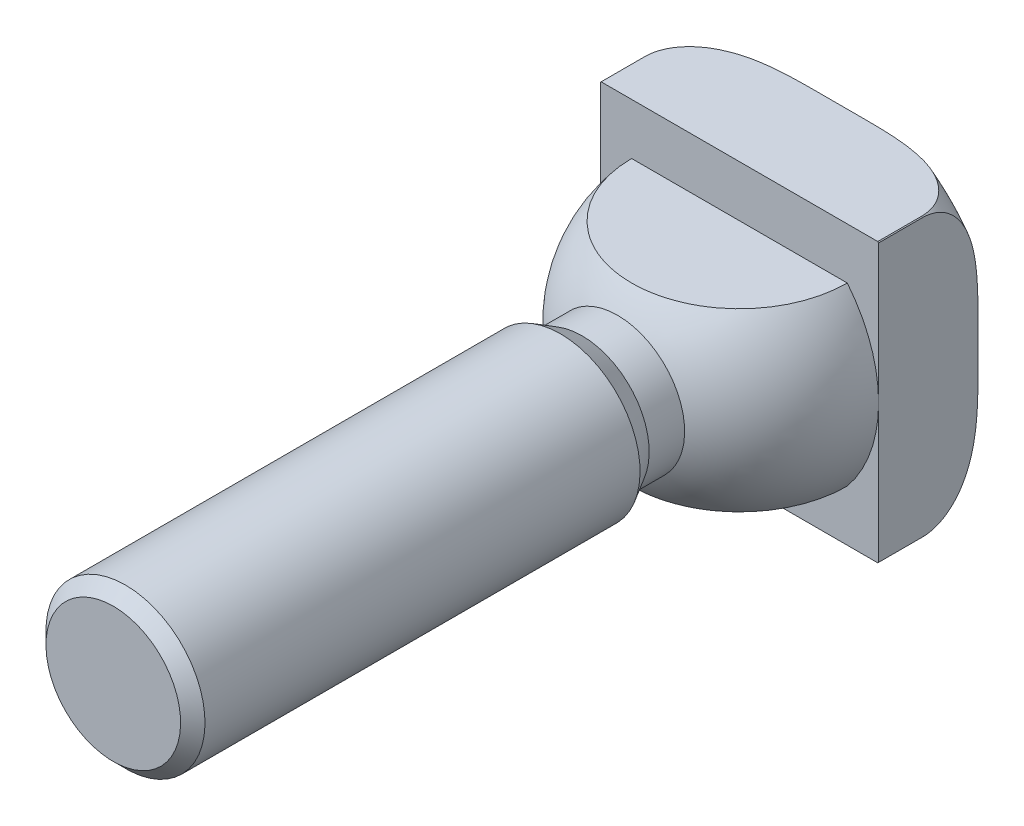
ISO-10303-21;
HEADER;
FILE_DESCRIPTION(('STEP AP214'),'2;1');
FILE_NAME('part.step','',(''),(''),'','','');
FILE_SCHEMA(('AUTOMOTIVE_DESIGN { 1 0 10303 214 1 1 1 1 }'));
ENDSEC;
DATA;
#1=APPLICATION_CONTEXT('core data for automotive mechanical design processes');
#2=APPLICATION_PROTOCOL_DEFINITION('international standard','automotive_design',2000,#1);
#3=PRODUCT_CONTEXT('',#1,'mechanical');
#4=PRODUCT('Part','Part','',(#3));
#5=PRODUCT_RELATED_PRODUCT_CATEGORY('part','',(#4));
#6=PRODUCT_DEFINITION_FORMATION('','',#4);
#7=PRODUCT_DEFINITION_CONTEXT('part definition',#1,'design');
#8=PRODUCT_DEFINITION('design','',#6,#7);
#9=PRODUCT_DEFINITION_SHAPE('','',#8);
#10=(LENGTH_UNIT() NAMED_UNIT(*) SI_UNIT(.MILLI.,.METRE.));
#11=(NAMED_UNIT(*) PLANE_ANGLE_UNIT() SI_UNIT($,.RADIAN.));
#12=(NAMED_UNIT(*) SI_UNIT($,.STERADIAN.) SOLID_ANGLE_UNIT());
#13=UNCERTAINTY_MEASURE_WITH_UNIT(LENGTH_MEASURE(1.E-05),#10,'distance_accuracy_value','');
#14=(GEOMETRIC_REPRESENTATION_CONTEXT(3) GLOBAL_UNCERTAINTY_ASSIGNED_CONTEXT((#13)) GLOBAL_UNIT_ASSIGNED_CONTEXT((#10,
#11,#12)) REPRESENTATION_CONTEXT('',''));
#15=CARTESIAN_POINT('',(0.,0.,0.));
#16=DIRECTION('',(0.,0.,1.));
#17=DIRECTION('',(1.,0.,0.));
#18=AXIS2_PLACEMENT_3D('',#15,#16,#17);
#19=CARTESIAN_POINT('',(0.,0.,-4.4));
#20=DIRECTION('',(0.,0.,1.));
#21=DIRECTION('',(0.,1.,0.));
#22=AXIS2_PLACEMENT_3D('',#19,#20,#21);
#23=TOROIDAL_SURFACE('',#22,14.14,5.6);
#24=CARTESIAN_POINT('',(-14.,0.,-9.99824972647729));
#25=CARTESIAN_POINT('',(-14.,-0.310759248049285,-9.99825085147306));
#26=CARTESIAN_POINT('',(-14.,-0.621518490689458,-9.99853784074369));
#27=CARTESIAN_POINT('',(-14.,-1.24303661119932,-9.99934060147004));
#28=CARTESIAN_POINT('',(-14.,-1.55379548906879,-9.99985637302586));
#29=CARTESIAN_POINT('',(-14.,-2.17555675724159,-10.0000957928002));
#30=CARTESIAN_POINT('',(-14.,-2.48655914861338,-9.99981882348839));
#31=CARTESIAN_POINT('',(-14.,-3.10856376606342,-9.99683999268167));
#32=CARTESIAN_POINT('',(-14.,-3.41956599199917,-9.99413807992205));
#33=CARTESIAN_POINT('',(-14.,-4.04142447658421,-9.98415314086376));
#34=CARTESIAN_POINT('',(-14.,-4.35228075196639,-9.97687135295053));
#35=CARTESIAN_POINT('',(-14.,-4.97375164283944,-9.95513103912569));
#36=CARTESIAN_POINT('',(-14.,-5.28436626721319,-9.94067279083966));
#37=CARTESIAN_POINT('',(-14.,-5.90457312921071,-9.90163480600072));
#38=CARTESIAN_POINT('',(-14.,-6.21416618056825,-9.87706873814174));
#39=CARTESIAN_POINT('',(-14.,-6.83210242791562,-9.8145243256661));
#40=CARTESIAN_POINT('',(-14.,-7.14044538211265,-9.77654350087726));
#41=CARTESIAN_POINT('',(-14.,-7.76037724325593,-9.68271738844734));
#42=CARTESIAN_POINT('',(-14.,-8.07191904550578,-9.62655135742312));
#43=CARTESIAN_POINT('',(-14.,-8.69023154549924,-9.49254678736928));
#44=CARTESIAN_POINT('',(-14.,-8.99700487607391,-9.41472069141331));
#45=CARTESIAN_POINT('',(-14.,-9.60149117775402,-9.23352582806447));
#46=CARTESIAN_POINT('',(-14.,-9.89923995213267,-9.13027881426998));
#47=CARTESIAN_POINT('',(-14.,-10.4824504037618,-8.89388231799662));
#48=CARTESIAN_POINT('',(-14.,-10.7679262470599,-8.76076847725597));
#49=CARTESIAN_POINT('',(-14.,-11.3136573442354,-8.46441782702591));
#50=CARTESIAN_POINT('',(-14.,-11.5743689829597,-8.30203188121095));
#51=CARTESIAN_POINT('',(-14.,-12.0709995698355,-7.94177662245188));
#52=CARTESIAN_POINT('',(-14.,-12.3068984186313,-7.74387888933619));
#53=CARTESIAN_POINT('',(-14.,-12.63518165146,-7.4188785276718));
#54=CARTESIAN_POINT('',(-14.,-12.7408989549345,-7.30509090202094));
#55=CARTESIAN_POINT('',(-14.,-12.9416863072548,-7.06851889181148));
#56=CARTESIAN_POINT('',(-14.,-13.0367621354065,-6.94573945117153));
#57=CARTESIAN_POINT('',(-14.,-13.2145748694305,-6.6917702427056));
#58=CARTESIAN_POINT('',(-14.,-13.2973291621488,-6.56059270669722));
#59=CARTESIAN_POINT('',(-14.,-13.4490161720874,-6.2905462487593));
#60=CARTESIAN_POINT('',(-14.,-13.5179540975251,-6.15168025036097));
#61=CARTESIAN_POINT('',(-14.,-13.6697783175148,-5.79932831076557));
#62=CARTESIAN_POINT('',(-14.,-13.7436357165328,-5.58184122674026));
#63=CARTESIAN_POINT('',(-14.,-13.8537149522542,-5.13762264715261));
#64=CARTESIAN_POINT('',(-14.,-13.8899558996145,-4.91089590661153));
#65=CARTESIAN_POINT('',(-14.,-13.9227119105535,-4.45413617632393));
#66=CARTESIAN_POINT('',(-14.,-13.9191559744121,-4.22409800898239));
#67=CARTESIAN_POINT('',(-14.,-13.8723552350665,-3.76811077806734));
#68=CARTESIAN_POINT('',(-14.,-13.8291052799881,-3.54216224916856));
#69=CARTESIAN_POINT('',(-14.,-13.7070151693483,-3.10597064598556));
#70=CARTESIAN_POINT('',(-14.,-13.6290387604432,-2.89548280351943));
#71=CARTESIAN_POINT('',(-14.,-13.4418093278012,-2.48903531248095));
#72=CARTESIAN_POINT('',(-14.,-13.3325526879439,-2.29307734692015));
#73=CARTESIAN_POINT('',(-14.,-13.0760306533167,-1.90105488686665));
#74=CARTESIAN_POINT('',(-14.,-12.9261604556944,-1.70670634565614));
#75=CARTESIAN_POINT('',(-14.,-12.6009114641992,-1.34062905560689));
#76=CARTESIAN_POINT('',(-14.,-12.425510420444,-1.16892028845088));
#77=CARTESIAN_POINT('',(-14.,-12.0933369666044,-0.881603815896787));
#78=CARTESIAN_POINT('',(-14.,-11.9401944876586,-0.76173253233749));
#79=CARTESIAN_POINT('',(-14.,-11.6238593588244,-0.535952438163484));
#80=CARTESIAN_POINT('',(-14.,-11.4606616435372,-0.430050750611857));
#81=CARTESIAN_POINT('',(-14.,-11.1262197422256,-0.231514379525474));
#82=CARTESIAN_POINT('',(-14.,-10.9549677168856,-0.138892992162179));
#83=CARTESIAN_POINT('',(-14.,-10.6063402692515,0.0338060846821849));
#84=CARTESIAN_POINT('',(-14.,-10.428965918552,0.113885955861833));
#85=CARTESIAN_POINT('',(-14.,-9.95291874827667,0.3106674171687));
#86=CARTESIAN_POINT('',(-14.,-9.65013791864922,0.41746585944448));
#87=CARTESIAN_POINT('',(-14.,-9.03638107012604,0.604202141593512));
#88=CARTESIAN_POINT('',(-14.,-8.72539881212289,0.684118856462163));
#89=CARTESIAN_POINT('',(-14.,-8.09734857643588,0.821773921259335));
#90=CARTESIAN_POINT('',(-14.,-7.78026113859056,0.879421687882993));
#91=CARTESIAN_POINT('',(-14.,-7.14352292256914,0.976351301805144));
#92=CARTESIAN_POINT('',(-14.,-6.82387330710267,1.01564104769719));
#93=CARTESIAN_POINT('',(-14.,-6.08602362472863,1.08964790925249));
#94=CARTESIAN_POINT('',(-14.,-5.66733893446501,1.1193635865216));
#95=CARTESIAN_POINT('',(-14.,-4.82908628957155,1.16245287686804));
#96=CARTESIAN_POINT('',(-14.,-4.40951805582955,1.17582016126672));
#97=CARTESIAN_POINT('',(-14.,-3.56968565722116,1.19303029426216));
#98=CARTESIAN_POINT('',(-14.,-3.14942129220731,1.19686084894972));
#99=CARTESIAN_POINT('',(-14.,-2.30895829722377,1.20041358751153));
#100=CARTESIAN_POINT('',(-14.,-1.88875966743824,1.20013642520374));
#101=CARTESIAN_POINT('',(-14.,-1.04864396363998,1.19915092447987));
#102=CARTESIAN_POINT('',(-14.,-0.628726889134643,1.19844287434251));
#103=CARTESIAN_POINT('',(-14.,0.21112726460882,1.19813401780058));
#104=CARTESIAN_POINT('',(-14.,0.631064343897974,1.19853326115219));
#105=CARTESIAN_POINT('',(-14.,1.47068212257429,1.19965885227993));
#106=CARTESIAN_POINT('',(-14.,1.89036282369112,1.20038500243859));
#107=CARTESIAN_POINT('',(-14.,2.72971643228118,1.19918094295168));
#108=CARTESIAN_POINT('',(-14.,3.14938933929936,1.19725084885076));
#109=CARTESIAN_POINT('',(-14.,3.72184106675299,1.18945550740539));
#110=CARTESIAN_POINT('',(-14.,3.87466005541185,1.18687249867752));
#111=CARTESIAN_POINT('',(-14.,4.18027065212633,1.18040049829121));
#112=CARTESIAN_POINT('',(-14.,4.33306226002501,1.17651149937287));
#113=CARTESIAN_POINT('',(-14.,4.79139482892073,1.16242966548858));
#114=CARTESIAN_POINT('',(-14.,5.09687074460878,1.14982221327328));
#115=CARTESIAN_POINT('',(-14.,5.70773033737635,1.11539646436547));
#116=CARTESIAN_POINT('',(-14.,6.01311337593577,1.0935661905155));
#117=CARTESIAN_POINT('',(-14.,6.62278129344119,1.03760824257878));
#118=CARTESIAN_POINT('',(-14.,6.92706622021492,1.0034811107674));
#119=CARTESIAN_POINT('',(-14.,7.53756680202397,0.919002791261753));
#120=CARTESIAN_POINT('',(-14.,7.84375430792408,0.868441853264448));
#121=CARTESIAN_POINT('',(-14.,8.45235679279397,0.747440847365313));
#122=CARTESIAN_POINT('',(-14.,8.75477072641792,0.676995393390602));
#123=CARTESIAN_POINT('',(-14.,9.35221826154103,0.512485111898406));
#124=CARTESIAN_POINT('',(-14.,9.64727195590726,0.418494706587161));
#125=CARTESIAN_POINT('',(-14.,10.2269376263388,0.202797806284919));
#126=CARTESIAN_POINT('',(-14.,10.5115593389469,0.0811179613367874));
#127=CARTESIAN_POINT('',(-14.,11.073245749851,-0.197865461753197));
#128=CARTESIAN_POINT('',(-14.,11.3498592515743,-0.356091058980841));
#129=CARTESIAN_POINT('',(-14.,11.8788610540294,-0.709917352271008));
#130=CARTESIAN_POINT('',(-14.,12.1312420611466,-0.905529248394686));
#131=CARTESIAN_POINT('',(-14.,12.4845698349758,-1.22925474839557));
#132=CARTESIAN_POINT('',(-14.,12.5987850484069,-1.34304039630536));
#133=CARTESIAN_POINT('',(-14.,12.8164661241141,-1.58042428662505));
#134=CARTESIAN_POINT('',(-14.,12.9199380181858,-1.70401695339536));
#135=CARTESIAN_POINT('',(-14.,13.1142800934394,-1.9605135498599));
#136=CARTESIAN_POINT('',(-14.,13.205167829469,-2.09340411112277));
#137=CARTESIAN_POINT('',(-14.,13.372664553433,-2.36782024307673));
#138=CARTESIAN_POINT('',(-14.,13.4492796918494,-2.50934205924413));
#139=CARTESIAN_POINT('',(-14.,13.6163411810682,-2.86319975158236));
#140=CARTESIAN_POINT('',(-14.,13.6983634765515,-3.07961651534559));
#141=CARTESIAN_POINT('',(-14.,13.824923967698,-3.52306568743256));
#142=CARTESIAN_POINT('',(-14.,13.8694841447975,-3.75009178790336));
#143=CARTESIAN_POINT('',(-14.,13.9185610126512,-4.2090333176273));
#144=CARTESIAN_POINT('',(-14.,13.9229835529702,-4.44095896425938));
#145=CARTESIAN_POINT('',(-14.,13.8912351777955,-4.90200336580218));
#146=CARTESIAN_POINT('',(-14.,13.8550611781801,-5.13112190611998));
#147=CARTESIAN_POINT('',(-14.,13.7462858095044,-5.5721594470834));
#148=CARTESIAN_POINT('',(-14.,13.6749635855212,-5.78439832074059));
#149=CARTESIAN_POINT('',(-14.,13.5003447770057,-6.19518406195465));
#150=CARTESIAN_POINT('',(-14.,13.3970432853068,-6.39372882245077));
#151=CARTESIAN_POINT('',(-14.,13.1534590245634,-6.78957755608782));
#152=CARTESIAN_POINT('',(-14.,13.0108272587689,-6.98542587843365));
#153=CARTESIAN_POINT('',(-14.,12.6995996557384,-7.35524295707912));
#154=CARTESIAN_POINT('',(-14.,12.5309874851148,-7.52919782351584));
#155=CARTESIAN_POINT('',(-14.,12.2128466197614,-7.81886907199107));
#156=CARTESIAN_POINT('',(-14.,12.0672621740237,-7.93898454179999));
#157=CARTESIAN_POINT('',(-14.,11.7660321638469,-8.16591189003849));
#158=CARTESIAN_POINT('',(-14.,11.6103820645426,-8.272717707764));
#159=CARTESIAN_POINT('',(-14.,11.1309674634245,-8.57419374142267));
#160=CARTESIAN_POINT('',(-14.,10.7950194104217,-8.74967609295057));
#161=CARTESIAN_POINT('',(-14.,10.1706537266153,-9.02589055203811));
#162=CARTESIAN_POINT('',(-14.,9.88556746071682,-9.13451214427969));
#163=CARTESIAN_POINT('',(-14.,9.30681398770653,-9.32642336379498));
#164=CARTESIAN_POINT('',(-14.,9.01314069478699,-9.40969452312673));
#165=CARTESIAN_POINT('',(-14.,8.42011381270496,-9.55475710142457));
#166=CARTESIAN_POINT('',(-14.,8.12075104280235,-9.61651002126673));
#167=CARTESIAN_POINT('',(-14.,7.51883351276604,-9.72211873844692));
#168=CARTESIAN_POINT('',(-14.,7.21627753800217,-9.76596745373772));
#169=CARTESIAN_POINT('',(-14.,6.6268227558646,-9.83715592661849));
#170=CARTESIAN_POINT('',(-14.,6.34001723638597,-9.86529590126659));
#171=CARTESIAN_POINT('',(-14.,5.76566600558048,-9.91149411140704));
#172=CARTESIAN_POINT('',(-14.,5.47812040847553,-9.92955381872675));
#173=CARTESIAN_POINT('',(-14.,4.90241848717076,-9.95811498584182));
#174=CARTESIAN_POINT('',(-14.,4.61426184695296,-9.96860968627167));
#175=CARTESIAN_POINT('',(-14.,4.0378073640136,-9.98427067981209));
#176=CARTESIAN_POINT('',(-14.,3.74950951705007,-9.98943680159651));
#177=CARTESIAN_POINT('',(-14.,3.17268829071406,-9.99640544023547));
#178=CARTESIAN_POINT('',(-14.,2.88416488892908,-9.99820571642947));
#179=CARTESIAN_POINT('',(-14.,2.30711989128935,-10.0000585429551));
#180=CARTESIAN_POINT('',(-14.,2.01859829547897,-10.0001111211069));
#181=CARTESIAN_POINT('',(-14.,1.44173081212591,-9.99968852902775));
#182=CARTESIAN_POINT('',(-14.,1.1533849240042,-9.99921367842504));
#183=CARTESIAN_POINT('',(-14.,0.576692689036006,-9.99849375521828));
#184=CARTESIAN_POINT('',(-14.,0.2883463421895,-9.99824868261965));
#185=CARTESIAN_POINT('',(-14.,0.,-9.99824972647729));
#186=B_SPLINE_CURVE_WITH_KNOTS('',3,(#24,#25,#26,#27,#28,#29,#30,#31,#32,#33,#34,#35,#36,#37,
#38,#39,#40,#41,#42,#43,#44,#45,#46,#47,#48,#49,#50,#51,#52,#53,#54,#55,#56,#57,#58,#59,#60,#61,
#62,#63,#64,#65,#66,#67,#68,#69,#70,#71,#72,#73,#74,#75,#76,#77,#78,#79,#80,#81,#82,#83,#84,#85,
#86,#87,#88,#89,#90,#91,#92,#93,#94,#95,#96,#97,#98,#99,#100,#101,#102,#103,#104,#105,#106,#107,
#108,#109,#110,#111,#112,#113,#114,#115,#116,#117,#118,#119,#120,#121,#122,#123,#124,#125,#126,
#127,#128,#129,#130,#131,#132,#133,#134,#135,#136,#137,#138,#139,#140,#141,#142,#143,#144,#145,
#146,#147,#148,#149,#150,#151,#152,#153,#154,#155,#156,#157,#158,#159,#160,#161,#162,#163,#164,
#165,#166,#167,#168,#169,#170,#171,#172,#173,#174,#175,#176,#177,#178,#179,#180,#181,#182,#183,
#184,#185),.UNSPECIFIED.,.T.,.F.,(4,2,2,2,2,2,2,2,2,2,2,2,2,2,2,2,2,2,2,2,2,2,2,2,2,2,2,2,2,2,2,
2,2,2,2,2,2,2,2,2,2,2,2,2,2,2,2,2,2,2,2,2,2,2,2,2,2,2,2,2,2,2,2,2,2,2,2,2,2,2,2,2,2,2,2,2,2,2,2,
2,4),(0.,0.932277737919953,1.86455588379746,2.79756045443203,3.73058474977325,4.66335686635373,
5.59609290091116,6.52757173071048,7.45922286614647,8.40829357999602,9.35682020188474,
10.3008893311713,11.2438377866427,12.1628389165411,13.0825788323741,13.5480143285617,
14.0131958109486,14.4777145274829,14.9420578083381,15.6278649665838,16.3133235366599,
17.0000051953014,17.6867759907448,18.3573439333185,19.0279894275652,19.7615747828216,
20.4958033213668,21.0784512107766,21.6613950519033,22.2449185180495,22.8283403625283,
23.7898904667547,24.7521944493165,25.7183725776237,26.6841346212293,27.9428211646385,
29.2019948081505,30.4627908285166,31.7233861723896,32.9831390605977,34.2429485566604,
35.5019975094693,36.7609916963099,37.2195087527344,37.6780283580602,38.5951359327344,
39.5134381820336,40.4316999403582,41.3621750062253,42.2929023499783,43.220724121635,
44.1476566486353,45.1011871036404,46.0550036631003,46.5381223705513,47.0209683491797,
47.5031338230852,47.985091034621,48.676179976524,49.3668631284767,50.0591659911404,
50.7515214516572,51.4203582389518,52.089297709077,52.8134628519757,53.5380851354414,
54.1035302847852,54.6692319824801,55.8017422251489,56.7158020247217,57.6305261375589,
58.5468785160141,59.4635930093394,60.3279216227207,61.1921240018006,62.0570975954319,
62.9220989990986,63.7876760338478,64.6532392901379,65.5182782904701,66.3833173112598),.UNSPECIFIED.);
#187=CARTESIAN_POINT('',(-14.,-1.98484256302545,-10.));
#188=VERTEX_POINT('',#187);
#189=CARTESIAN_POINT('',(-14.,-13.916450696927,-4.4));
#190=VERTEX_POINT('',#189);
#191=EDGE_CURVE('E216',#188,#190,#186,.T.);
#192=ORIENTED_EDGE('',*,*,#191,.F.);
#193=CARTESIAN_POINT('',(0.,0.,-10.));
#194=DIRECTION('',(0.,0.,1.));
#195=DIRECTION('',(0.,1.,0.));
#196=AXIS2_PLACEMENT_3D('',#193,#194,#195);
#197=CIRCLE('',#196,14.14);
#198=CARTESIAN_POINT('',(-1.98484256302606,-14.,-10.));
#199=VERTEX_POINT('',#198);
#200=EDGE_CURVE('E291',#188,#199,#197,.T.);
#201=ORIENTED_EDGE('',*,*,#200,.T.);
#202=CARTESIAN_POINT('',(0.,-14.,-9.99824972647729));
#203=CARTESIAN_POINT('',(0.310759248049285,-14.,-9.99825085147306));
#204=CARTESIAN_POINT('',(0.621518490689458,-14.,-9.99853784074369));
#205=CARTESIAN_POINT('',(1.24303661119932,-14.,-9.99934060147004));
#206=CARTESIAN_POINT('',(1.55379548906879,-14.,-9.99985637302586));
#207=CARTESIAN_POINT('',(2.17555675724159,-14.,-10.0000957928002));
#208=CARTESIAN_POINT('',(2.48655914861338,-14.,-9.99981882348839));
#209=CARTESIAN_POINT('',(3.10856376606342,-14.,-9.99683999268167));
#210=CARTESIAN_POINT('',(3.41956599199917,-14.,-9.99413807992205));
#211=CARTESIAN_POINT('',(4.04142447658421,-14.,-9.98415314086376));
#212=CARTESIAN_POINT('',(4.35228075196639,-14.,-9.97687135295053));
#213=CARTESIAN_POINT('',(4.97375164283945,-14.,-9.95513103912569));
#214=CARTESIAN_POINT('',(5.28436626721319,-14.,-9.94067279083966));
#215=CARTESIAN_POINT('',(5.90457312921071,-14.,-9.90163480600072));
#216=CARTESIAN_POINT('',(6.21416618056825,-14.,-9.87706873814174));
#217=CARTESIAN_POINT('',(6.83210242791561,-14.,-9.8145243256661));
#218=CARTESIAN_POINT('',(7.14044538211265,-14.,-9.77654350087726));
#219=CARTESIAN_POINT('',(7.76037724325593,-14.,-9.68271738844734));
#220=CARTESIAN_POINT('',(8.07191904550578,-14.,-9.62655135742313));
#221=CARTESIAN_POINT('',(8.69023154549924,-14.,-9.49254678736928));
#222=CARTESIAN_POINT('',(8.99700487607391,-14.,-9.41472069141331));
#223=CARTESIAN_POINT('',(9.60149117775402,-14.,-9.23352582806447));
#224=CARTESIAN_POINT('',(9.89923995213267,-14.,-9.13027881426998));
#225=CARTESIAN_POINT('',(10.4824504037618,-14.,-8.89388231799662));
#226=CARTESIAN_POINT('',(10.7679262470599,-14.,-8.76076847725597));
#227=CARTESIAN_POINT('',(11.3136573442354,-14.,-8.46441782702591));
#228=CARTESIAN_POINT('',(11.5743689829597,-14.,-8.30203188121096));
#229=CARTESIAN_POINT('',(12.0709995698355,-14.,-7.94177662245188));
#230=CARTESIAN_POINT('',(12.3068984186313,-14.,-7.74387888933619));
#231=CARTESIAN_POINT('',(12.63518165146,-14.,-7.4188785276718));
#232=CARTESIAN_POINT('',(12.7408989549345,-14.,-7.30509090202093));
#233=CARTESIAN_POINT('',(12.9416863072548,-14.,-7.06851889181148));
#234=CARTESIAN_POINT('',(13.0367621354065,-14.,-6.94573945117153));
#235=CARTESIAN_POINT('',(13.2145748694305,-14.,-6.69177024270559));
#236=CARTESIAN_POINT('',(13.2973291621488,-14.,-6.56059270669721));
#237=CARTESIAN_POINT('',(13.4490161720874,-14.,-6.2905462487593));
#238=CARTESIAN_POINT('',(13.5179540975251,-14.,-6.15168025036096));
#239=CARTESIAN_POINT('',(13.6697783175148,-14.,-5.79932831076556));
#240=CARTESIAN_POINT('',(13.7436357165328,-14.,-5.58184122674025));
#241=CARTESIAN_POINT('',(13.8537149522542,-14.,-5.13762264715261));
#242=CARTESIAN_POINT('',(13.8899558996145,-14.,-4.91089590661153));
#243=CARTESIAN_POINT('',(13.9227119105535,-14.,-4.45413617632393));
#244=CARTESIAN_POINT('',(13.9191559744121,-14.,-4.22409800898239));
#245=CARTESIAN_POINT('',(13.8723552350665,-14.,-3.76811077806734));
#246=CARTESIAN_POINT('',(13.8291052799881,-14.,-3.54216224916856));
#247=CARTESIAN_POINT('',(13.7070151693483,-14.,-3.10597064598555));
#248=CARTESIAN_POINT('',(13.6290387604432,-14.,-2.89548280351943));
#249=CARTESIAN_POINT('',(13.4418093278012,-14.,-2.48903531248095));
#250=CARTESIAN_POINT('',(13.3325526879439,-14.,-2.29307734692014));
#251=CARTESIAN_POINT('',(13.0760306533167,-14.,-1.90105488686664));
#252=CARTESIAN_POINT('',(12.9261604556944,-14.,-1.70670634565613));
#253=CARTESIAN_POINT('',(12.6009114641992,-14.,-1.34062905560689));
#254=CARTESIAN_POINT('',(12.425510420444,-14.,-1.16892028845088));
#255=CARTESIAN_POINT('',(12.0933369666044,-14.,-0.881603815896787));
#256=CARTESIAN_POINT('',(11.9401944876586,-14.,-0.76173253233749));
#257=CARTESIAN_POINT('',(11.6238593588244,-14.,-0.535952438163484));
#258=CARTESIAN_POINT('',(11.4606616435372,-14.,-0.430050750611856));
#259=CARTESIAN_POINT('',(11.1262197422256,-14.,-0.231514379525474));
#260=CARTESIAN_POINT('',(10.9549677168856,-14.,-0.138892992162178));
#261=CARTESIAN_POINT('',(10.6063402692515,-14.,0.0338060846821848));
#262=CARTESIAN_POINT('',(10.428965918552,-14.,0.113885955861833));
#263=CARTESIAN_POINT('',(9.95291874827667,-14.,0.3106674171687));
#264=CARTESIAN_POINT('',(9.65013791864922,-14.,0.417465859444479));
#265=CARTESIAN_POINT('',(9.03638107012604,-14.,0.604202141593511));
#266=CARTESIAN_POINT('',(8.72539881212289,-14.,0.684118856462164));
#267=CARTESIAN_POINT('',(8.09734857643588,-14.,0.821773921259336));
#268=CARTESIAN_POINT('',(7.78026113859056,-14.,0.879421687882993));
#269=CARTESIAN_POINT('',(7.14352292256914,-14.,0.976351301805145));
#270=CARTESIAN_POINT('',(6.82387330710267,-14.,1.01564104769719));
#271=CARTESIAN_POINT('',(6.08602362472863,-14.,1.08964790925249));
#272=CARTESIAN_POINT('',(5.66733893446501,-14.,1.1193635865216));
#273=CARTESIAN_POINT('',(4.82908628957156,-14.,1.16245287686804));
#274=CARTESIAN_POINT('',(4.40951805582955,-14.,1.17582016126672));
#275=CARTESIAN_POINT('',(3.56968565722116,-14.,1.19303029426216));
#276=CARTESIAN_POINT('',(3.14942129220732,-14.,1.19686084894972));
#277=CARTESIAN_POINT('',(2.30895829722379,-14.,1.20041358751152));
#278=CARTESIAN_POINT('',(1.88875966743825,-14.,1.20013642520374));
#279=CARTESIAN_POINT('',(1.04864396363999,-14.,1.19915092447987));
#280=CARTESIAN_POINT('',(0.628726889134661,-14.,1.19844287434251));
#281=CARTESIAN_POINT('',(-0.211127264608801,-14.,1.19813401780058));
#282=CARTESIAN_POINT('',(-0.631064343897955,-14.,1.19853326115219));
#283=CARTESIAN_POINT('',(-1.47068212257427,-14.,1.19965885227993));
#284=CARTESIAN_POINT('',(-1.89036282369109,-14.,1.20038500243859));
#285=CARTESIAN_POINT('',(-2.72971643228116,-14.,1.19918094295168));
#286=CARTESIAN_POINT('',(-3.14938933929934,-14.,1.19725084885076));
#287=CARTESIAN_POINT('',(-3.72184106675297,-14.,1.18945550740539));
#288=CARTESIAN_POINT('',(-3.87466005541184,-14.,1.18687249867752));
#289=CARTESIAN_POINT('',(-4.18027065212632,-14.,1.18040049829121));
#290=CARTESIAN_POINT('',(-4.333062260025,-14.,1.17651149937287));
#291=CARTESIAN_POINT('',(-4.79139482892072,-14.,1.16242966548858));
#292=CARTESIAN_POINT('',(-5.09687074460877,-14.,1.14982221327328));
#293=CARTESIAN_POINT('',(-5.70773033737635,-14.,1.11539646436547));
#294=CARTESIAN_POINT('',(-6.01311337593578,-14.,1.0935661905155));
#295=CARTESIAN_POINT('',(-6.62278129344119,-14.,1.03760824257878));
#296=CARTESIAN_POINT('',(-6.92706622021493,-14.,1.0034811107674));
#297=CARTESIAN_POINT('',(-7.53756680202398,-14.,0.919002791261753));
#298=CARTESIAN_POINT('',(-7.8437543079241,-14.,0.868441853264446));
#299=CARTESIAN_POINT('',(-8.45235679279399,-14.,0.747440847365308));
#300=CARTESIAN_POINT('',(-8.75477072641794,-14.,0.676995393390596));
#301=CARTESIAN_POINT('',(-9.35221826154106,-14.,0.512485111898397));
#302=CARTESIAN_POINT('',(-9.64727195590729,-14.,0.41849470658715));
#303=CARTESIAN_POINT('',(-10.2269376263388,-14.,0.202797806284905));
#304=CARTESIAN_POINT('',(-10.5115593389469,-14.,0.081117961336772));
#305=CARTESIAN_POINT('',(-11.0732457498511,-14.,-0.197865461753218));
#306=CARTESIAN_POINT('',(-11.3498592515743,-14.,-0.356091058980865));
#307=CARTESIAN_POINT('',(-11.8788610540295,-14.,-0.709917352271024));
#308=CARTESIAN_POINT('',(-12.1312420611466,-14.,-0.905529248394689));
#309=CARTESIAN_POINT('',(-12.4845698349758,-14.,-1.22925474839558));
#310=CARTESIAN_POINT('',(-12.5987850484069,-14.,-1.34304039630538));
#311=CARTESIAN_POINT('',(-12.8164661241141,-14.,-1.58042428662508));
#312=CARTESIAN_POINT('',(-12.9199380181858,-14.,-1.70401695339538));
#313=CARTESIAN_POINT('',(-13.1142800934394,-14.,-1.96051354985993));
#314=CARTESIAN_POINT('',(-13.205167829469,-14.,-2.09340411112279));
#315=CARTESIAN_POINT('',(-13.372664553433,-14.,-2.36782024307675));
#316=CARTESIAN_POINT('',(-13.4492796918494,-14.,-2.50934205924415));
#317=CARTESIAN_POINT('',(-13.6163411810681,-14.,-2.86319975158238));
#318=CARTESIAN_POINT('',(-13.6983634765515,-14.,-3.07961651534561));
#319=CARTESIAN_POINT('',(-13.824923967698,-14.,-3.52306568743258));
#320=CARTESIAN_POINT('',(-13.8694841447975,-14.,-3.75009178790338));
#321=CARTESIAN_POINT('',(-13.9185610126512,-14.,-4.20903331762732));
#322=CARTESIAN_POINT('',(-13.9229835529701,-14.,-4.4409589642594));
#323=CARTESIAN_POINT('',(-13.8912351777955,-14.,-4.9020033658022));
#324=CARTESIAN_POINT('',(-13.8550611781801,-14.,-5.13112190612));
#325=CARTESIAN_POINT('',(-13.7462858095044,-14.,-5.57215944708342));
#326=CARTESIAN_POINT('',(-13.6749635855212,-14.,-5.78439832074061));
#327=CARTESIAN_POINT('',(-13.5003447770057,-14.,-6.19518406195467));
#328=CARTESIAN_POINT('',(-13.3970432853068,-14.,-6.39372882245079));
#329=CARTESIAN_POINT('',(-13.1534590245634,-14.,-6.78957755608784));
#330=CARTESIAN_POINT('',(-13.0108272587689,-14.,-6.98542587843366));
#331=CARTESIAN_POINT('',(-12.6995996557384,-14.,-7.35524295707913));
#332=CARTESIAN_POINT('',(-12.5309874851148,-14.,-7.52919782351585));
#333=CARTESIAN_POINT('',(-12.2128466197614,-14.,-7.81886907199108));
#334=CARTESIAN_POINT('',(-12.0672621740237,-14.,-7.93898454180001));
#335=CARTESIAN_POINT('',(-11.7660321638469,-14.,-8.16591189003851));
#336=CARTESIAN_POINT('',(-11.6103820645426,-14.,-8.27271770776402));
#337=CARTESIAN_POINT('',(-11.1309674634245,-14.,-8.57419374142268));
#338=CARTESIAN_POINT('',(-10.7950194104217,-14.,-8.74967609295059));
#339=CARTESIAN_POINT('',(-10.1706537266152,-14.,-9.02589055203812));
#340=CARTESIAN_POINT('',(-9.88556746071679,-14.,-9.1345121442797));
#341=CARTESIAN_POINT('',(-9.3068139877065,-14.,-9.32642336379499));
#342=CARTESIAN_POINT('',(-9.01314069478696,-14.,-9.40969452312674));
#343=CARTESIAN_POINT('',(-8.42011381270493,-14.,-9.55475710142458));
#344=CARTESIAN_POINT('',(-8.12075104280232,-14.,-9.61651002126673));
#345=CARTESIAN_POINT('',(-7.518833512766,-14.,-9.72211873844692));
#346=CARTESIAN_POINT('',(-7.21627753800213,-14.,-9.76596745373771));
#347=CARTESIAN_POINT('',(-6.62682275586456,-14.,-9.83715592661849));
#348=CARTESIAN_POINT('',(-6.34001723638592,-14.,-9.86529590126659));
#349=CARTESIAN_POINT('',(-5.76566600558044,-14.,-9.91149411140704));
#350=CARTESIAN_POINT('',(-5.4781204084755,-14.,-9.92955381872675));
#351=CARTESIAN_POINT('',(-4.90241848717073,-14.,-9.95811498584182));
#352=CARTESIAN_POINT('',(-4.61426184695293,-14.,-9.96860968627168));
#353=CARTESIAN_POINT('',(-4.03780736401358,-14.,-9.98427067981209));
#354=CARTESIAN_POINT('',(-3.74950951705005,-14.,-9.98943680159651));
#355=CARTESIAN_POINT('',(-3.17268829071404,-14.,-9.99640544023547));
#356=CARTESIAN_POINT('',(-2.88416488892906,-14.,-9.99820571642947));
#357=CARTESIAN_POINT('',(-2.30711989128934,-14.,-10.0000585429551));
#358=CARTESIAN_POINT('',(-2.01859829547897,-14.,-10.0001111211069));
#359=CARTESIAN_POINT('',(-1.4417308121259,-14.,-9.99968852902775));
#360=CARTESIAN_POINT('',(-1.1533849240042,-14.,-9.99921367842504));
#361=CARTESIAN_POINT('',(-0.576692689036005,-14.,-9.99849375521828));
#362=CARTESIAN_POINT('',(-0.2883463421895,-14.,-9.99824868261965));
#363=CARTESIAN_POINT('',(0.,-14.,-9.99824972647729));
#364=B_SPLINE_CURVE_WITH_KNOTS('',3,(#202,#203,#204,#205,#206,#207,#208,#209,#210,#211,#212,
#213,#214,#215,#216,#217,#218,#219,#220,#221,#222,#223,#224,#225,#226,#227,#228,#229,#230,#231,
#232,#233,#234,#235,#236,#237,#238,#239,#240,#241,#242,#243,#244,#245,#246,#247,#248,#249,#250,
#251,#252,#253,#254,#255,#256,#257,#258,#259,#260,#261,#262,#263,#264,#265,#266,#267,#268,#269,
#270,#271,#272,#273,#274,#275,#276,#277,#278,#279,#280,#281,#282,#283,#284,#285,#286,#287,#288,
#289,#290,#291,#292,#293,#294,#295,#296,#297,#298,#299,#300,#301,#302,#303,#304,#305,#306,#307,
#308,#309,#310,#311,#312,#313,#314,#315,#316,#317,#318,#319,#320,#321,#322,#323,#324,#325,#326,
#327,#328,#329,#330,#331,#332,#333,#334,#335,#336,#337,#338,#339,#340,#341,#342,#343,#344,#345,
#346,#347,#348,#349,#350,#351,#352,#353,#354,#355,#356,#357,#358,#359,#360,#361,#362,#363),
.UNSPECIFIED.,.T.,.F.,(4,2,2,2,2,2,2,2,2,2,2,2,2,2,2,2,2,2,2,2,2,2,2,2,2,2,2,2,2,2,2,2,2,2,2,2,
2,2,2,2,2,2,2,2,2,2,2,2,2,2,2,2,2,2,2,2,2,2,2,2,2,2,2,2,2,2,2,2,2,2,2,2,2,2,2,2,2,2,2,2,4),(0.,
0.932277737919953,1.86455588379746,2.79756045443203,3.73058474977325,4.66335686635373,
5.59609290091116,6.52757173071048,7.45922286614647,8.40829357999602,9.35682020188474,
10.3008893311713,11.2438377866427,12.1628389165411,13.0825788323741,13.5480143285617,
14.0131958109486,14.4777145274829,14.9420578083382,15.6278649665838,16.3133235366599,
17.0000051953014,17.6867759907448,18.3573439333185,19.0279894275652,19.7615747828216,
20.4958033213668,21.0784512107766,21.6613950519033,22.2449185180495,22.8283403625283,
23.7898904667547,24.7521944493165,25.7183725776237,26.6841346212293,27.9428211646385,
29.2019948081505,30.4627908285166,31.7233861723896,32.9831390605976,34.2429485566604,
35.5019975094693,36.7609916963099,37.2195087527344,37.6780283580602,38.5951359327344,
39.5134381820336,40.4316999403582,41.3621750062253,42.2929023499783,43.220724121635,
44.1476566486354,45.1011871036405,46.0550036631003,46.5381223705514,47.0209683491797,
47.5031338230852,47.9850910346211,48.676179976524,49.3668631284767,50.0591659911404,
50.7515214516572,51.4203582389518,52.089297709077,52.8134628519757,53.5380851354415,
54.1035302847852,54.6692319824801,55.8017422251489,56.7158020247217,57.6305261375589,
58.5468785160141,59.4635930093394,60.3279216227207,61.1921240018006,62.0570975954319,
62.9220989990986,63.7876760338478,64.6532392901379,65.5182782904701,66.3833173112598),.UNSPECIFIED.);
#365=CARTESIAN_POINT('',(-13.916450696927,-14.,-4.4));
#366=VERTEX_POINT('',#365);
#367=EDGE_CURVE('E177',#366,#199,#364,.T.);
#368=ORIENTED_EDGE('',*,*,#367,.F.);
#369=CARTESIAN_POINT('',(0.,0.,-4.4));
#370=DIRECTION('',(0.,0.,1.));
#371=DIRECTION('',(0.,1.,0.));
#372=AXIS2_PLACEMENT_3D('',#369,#370,#371);
#373=CIRCLE('',#372,19.74);
#374=EDGE_CURVE('E174',#190,#366,#373,.T.);
#375=ORIENTED_EDGE('',*,*,#374,.F.);
#376=EDGE_LOOP('',(#192,#201,#368,#375));
#377=FACE_BOUND('',#376,.T.);
#378=ADVANCED_FACE('F14',(#377),#23,.T.);
#379=CARTESIAN_POINT('',(1.98484256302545,-14.,-10.));
#380=VERTEX_POINT('',#379);
#381=CARTESIAN_POINT('',(13.916450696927,-14.,-4.4));
#382=VERTEX_POINT('',#381);
#383=EDGE_CURVE('E180',#380,#382,#364,.T.);
#384=ORIENTED_EDGE('',*,*,#383,.F.);
#385=CARTESIAN_POINT('',(14.,-1.98484256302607,-10.));
#386=VERTEX_POINT('',#385);
#387=EDGE_CURVE('E288',#380,#386,#197,.T.);
#388=ORIENTED_EDGE('',*,*,#387,.T.);
#389=CARTESIAN_POINT('',(14.,0.,-9.99824972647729));
#390=CARTESIAN_POINT('',(14.,0.310759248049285,-9.99825085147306));
#391=CARTESIAN_POINT('',(14.,0.621518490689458,-9.99853784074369));
#392=CARTESIAN_POINT('',(14.,1.24303661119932,-9.99934060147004));
#393=CARTESIAN_POINT('',(14.,1.55379548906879,-9.99985637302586));
#394=CARTESIAN_POINT('',(14.,2.17555675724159,-10.0000957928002));
#395=CARTESIAN_POINT('',(14.,2.48655914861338,-9.99981882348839));
#396=CARTESIAN_POINT('',(14.,3.10856376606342,-9.99683999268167));
#397=CARTESIAN_POINT('',(14.,3.41956599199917,-9.99413807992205));
#398=CARTESIAN_POINT('',(14.,4.04142447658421,-9.98415314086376));
#399=CARTESIAN_POINT('',(14.,4.35228075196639,-9.97687135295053));
#400=CARTESIAN_POINT('',(14.,4.97375164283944,-9.95513103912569));
#401=CARTESIAN_POINT('',(14.,5.28436626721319,-9.94067279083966));
#402=CARTESIAN_POINT('',(14.,5.90457312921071,-9.90163480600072));
#403=CARTESIAN_POINT('',(14.,6.21416618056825,-9.87706873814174));
#404=CARTESIAN_POINT('',(14.,6.83210242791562,-9.8145243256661));
#405=CARTESIAN_POINT('',(14.,7.14044538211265,-9.77654350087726));
#406=CARTESIAN_POINT('',(14.,7.76037724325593,-9.68271738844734));
#407=CARTESIAN_POINT('',(14.,8.07191904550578,-9.62655135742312));
#408=CARTESIAN_POINT('',(14.,8.69023154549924,-9.49254678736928));
#409=CARTESIAN_POINT('',(14.,8.99700487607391,-9.41472069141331));
#410=CARTESIAN_POINT('',(14.,9.60149117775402,-9.23352582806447));
#411=CARTESIAN_POINT('',(14.,9.89923995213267,-9.13027881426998));
#412=CARTESIAN_POINT('',(14.,10.4824504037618,-8.89388231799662));
#413=CARTESIAN_POINT('',(14.,10.7679262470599,-8.76076847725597));
#414=CARTESIAN_POINT('',(14.,11.3136573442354,-8.46441782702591));
#415=CARTESIAN_POINT('',(14.,11.5743689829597,-8.30203188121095));
#416=CARTESIAN_POINT('',(14.,12.0709995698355,-7.94177662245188));
#417=CARTESIAN_POINT('',(14.,12.3068984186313,-7.74387888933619));
#418=CARTESIAN_POINT('',(14.,12.63518165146,-7.4188785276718));
#419=CARTESIAN_POINT('',(14.,12.7408989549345,-7.30509090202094));
#420=CARTESIAN_POINT('',(14.,12.9416863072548,-7.06851889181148));
#421=CARTESIAN_POINT('',(14.,13.0367621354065,-6.94573945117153));
#422=CARTESIAN_POINT('',(14.,13.2145748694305,-6.6917702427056));
#423=CARTESIAN_POINT('',(14.,13.2973291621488,-6.56059270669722));
#424=CARTESIAN_POINT('',(14.,13.4490161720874,-6.2905462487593));
#425=CARTESIAN_POINT('',(14.,13.5179540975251,-6.15168025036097));
#426=CARTESIAN_POINT('',(14.,13.6697783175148,-5.79932831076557));
#427=CARTESIAN_POINT('',(14.,13.7436357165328,-5.58184122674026));
#428=CARTESIAN_POINT('',(14.,13.8537149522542,-5.13762264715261));
#429=CARTESIAN_POINT('',(14.,13.8899558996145,-4.91089590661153));
#430=CARTESIAN_POINT('',(14.,13.9227119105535,-4.45413617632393));
#431=CARTESIAN_POINT('',(14.,13.9191559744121,-4.22409800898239));
#432=CARTESIAN_POINT('',(14.,13.8723552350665,-3.76811077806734));
#433=CARTESIAN_POINT('',(14.,13.8291052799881,-3.54216224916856));
#434=CARTESIAN_POINT('',(14.,13.7070151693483,-3.10597064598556));
#435=CARTESIAN_POINT('',(14.,13.6290387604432,-2.89548280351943));
#436=CARTESIAN_POINT('',(14.,13.4418093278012,-2.48903531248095));
#437=CARTESIAN_POINT('',(14.,13.3325526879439,-2.29307734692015));
#438=CARTESIAN_POINT('',(14.,13.0760306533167,-1.90105488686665));
#439=CARTESIAN_POINT('',(14.,12.9261604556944,-1.70670634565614));
#440=CARTESIAN_POINT('',(14.,12.6009114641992,-1.34062905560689));
#441=CARTESIAN_POINT('',(14.,12.425510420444,-1.16892028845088));
#442=CARTESIAN_POINT('',(14.,12.0933369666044,-0.881603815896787));
#443=CARTESIAN_POINT('',(14.,11.9401944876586,-0.76173253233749));
#444=CARTESIAN_POINT('',(14.,11.6238593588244,-0.535952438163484));
#445=CARTESIAN_POINT('',(14.,11.4606616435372,-0.430050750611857));
#446=CARTESIAN_POINT('',(14.,11.1262197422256,-0.231514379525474));
#447=CARTESIAN_POINT('',(14.,10.9549677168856,-0.138892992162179));
#448=CARTESIAN_POINT('',(14.,10.6063402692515,0.0338060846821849));
#449=CARTESIAN_POINT('',(14.,10.428965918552,0.113885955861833));
#450=CARTESIAN_POINT('',(14.,9.95291874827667,0.3106674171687));
#451=CARTESIAN_POINT('',(14.,9.65013791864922,0.41746585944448));
#452=CARTESIAN_POINT('',(14.,9.03638107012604,0.604202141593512));
#453=CARTESIAN_POINT('',(14.,8.72539881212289,0.684118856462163));
#454=CARTESIAN_POINT('',(14.,8.09734857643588,0.821773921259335));
#455=CARTESIAN_POINT('',(14.,7.78026113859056,0.879421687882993));
#456=CARTESIAN_POINT('',(14.,7.14352292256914,0.976351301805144));
#457=CARTESIAN_POINT('',(14.,6.82387330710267,1.01564104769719));
#458=CARTESIAN_POINT('',(14.,6.08602362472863,1.08964790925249));
#459=CARTESIAN_POINT('',(14.,5.66733893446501,1.1193635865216));
#460=CARTESIAN_POINT('',(14.,4.82908628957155,1.16245287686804));
#461=CARTESIAN_POINT('',(14.,4.40951805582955,1.17582016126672));
#462=CARTESIAN_POINT('',(14.,3.56968565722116,1.19303029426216));
#463=CARTESIAN_POINT('',(14.,3.14942129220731,1.19686084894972));
#464=CARTESIAN_POINT('',(14.,2.30895829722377,1.20041358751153));
#465=CARTESIAN_POINT('',(14.,1.88875966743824,1.20013642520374));
#466=CARTESIAN_POINT('',(14.,1.04864396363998,1.19915092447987));
#467=CARTESIAN_POINT('',(14.,0.628726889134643,1.19844287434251));
#468=CARTESIAN_POINT('',(14.,-0.21112726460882,1.19813401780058));
#469=CARTESIAN_POINT('',(14.,-0.631064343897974,1.19853326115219));
#470=CARTESIAN_POINT('',(14.,-1.47068212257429,1.19965885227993));
#471=CARTESIAN_POINT('',(14.,-1.89036282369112,1.20038500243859));
#472=CARTESIAN_POINT('',(14.,-2.72971643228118,1.19918094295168));
#473=CARTESIAN_POINT('',(14.,-3.14938933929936,1.19725084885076));
#474=CARTESIAN_POINT('',(14.,-3.72184106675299,1.18945550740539));
#475=CARTESIAN_POINT('',(14.,-3.87466005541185,1.18687249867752));
#476=CARTESIAN_POINT('',(14.,-4.18027065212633,1.18040049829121));
#477=CARTESIAN_POINT('',(14.,-4.33306226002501,1.17651149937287));
#478=CARTESIAN_POINT('',(14.,-4.79139482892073,1.16242966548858));
#479=CARTESIAN_POINT('',(14.,-5.09687074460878,1.14982221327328));
#480=CARTESIAN_POINT('',(14.,-5.70773033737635,1.11539646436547));
#481=CARTESIAN_POINT('',(14.,-6.01311337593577,1.0935661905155));
#482=CARTESIAN_POINT('',(14.,-6.62278129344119,1.03760824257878));
#483=CARTESIAN_POINT('',(14.,-6.92706622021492,1.0034811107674));
#484=CARTESIAN_POINT('',(14.,-7.53756680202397,0.919002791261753));
#485=CARTESIAN_POINT('',(14.,-7.84375430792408,0.868441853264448));
#486=CARTESIAN_POINT('',(14.,-8.45235679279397,0.747440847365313));
#487=CARTESIAN_POINT('',(14.,-8.75477072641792,0.676995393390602));
#488=CARTESIAN_POINT('',(14.,-9.35221826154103,0.512485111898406));
#489=CARTESIAN_POINT('',(14.,-9.64727195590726,0.418494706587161));
#490=CARTESIAN_POINT('',(14.,-10.2269376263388,0.202797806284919));
#491=CARTESIAN_POINT('',(14.,-10.5115593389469,0.0811179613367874));
#492=CARTESIAN_POINT('',(14.,-11.073245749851,-0.197865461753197));
#493=CARTESIAN_POINT('',(14.,-11.3498592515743,-0.356091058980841));
#494=CARTESIAN_POINT('',(14.,-11.8788610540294,-0.709917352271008));
#495=CARTESIAN_POINT('',(14.,-12.1312420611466,-0.905529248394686));
#496=CARTESIAN_POINT('',(14.,-12.4845698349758,-1.22925474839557));
#497=CARTESIAN_POINT('',(14.,-12.5987850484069,-1.34304039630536));
#498=CARTESIAN_POINT('',(14.,-12.8164661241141,-1.58042428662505));
#499=CARTESIAN_POINT('',(14.,-12.9199380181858,-1.70401695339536));
#500=CARTESIAN_POINT('',(14.,-13.1142800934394,-1.9605135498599));
#501=CARTESIAN_POINT('',(14.,-13.205167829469,-2.09340411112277));
#502=CARTESIAN_POINT('',(14.,-13.372664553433,-2.36782024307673));
#503=CARTESIAN_POINT('',(14.,-13.4492796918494,-2.50934205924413));
#504=CARTESIAN_POINT('',(14.,-13.6163411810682,-2.86319975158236));
#505=CARTESIAN_POINT('',(14.,-13.6983634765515,-3.07961651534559));
#506=CARTESIAN_POINT('',(14.,-13.824923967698,-3.52306568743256));
#507=CARTESIAN_POINT('',(14.,-13.8694841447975,-3.75009178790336));
#508=CARTESIAN_POINT('',(14.,-13.9185610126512,-4.2090333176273));
#509=CARTESIAN_POINT('',(14.,-13.9229835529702,-4.44095896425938));
#510=CARTESIAN_POINT('',(14.,-13.8912351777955,-4.90200336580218));
#511=CARTESIAN_POINT('',(14.,-13.8550611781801,-5.13112190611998));
#512=CARTESIAN_POINT('',(14.,-13.7462858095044,-5.5721594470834));
#513=CARTESIAN_POINT('',(14.,-13.6749635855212,-5.78439832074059));
#514=CARTESIAN_POINT('',(14.,-13.5003447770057,-6.19518406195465));
#515=CARTESIAN_POINT('',(14.,-13.3970432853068,-6.39372882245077));
#516=CARTESIAN_POINT('',(14.,-13.1534590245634,-6.78957755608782));
#517=CARTESIAN_POINT('',(14.,-13.0108272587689,-6.98542587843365));
#518=CARTESIAN_POINT('',(14.,-12.6995996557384,-7.35524295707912));
#519=CARTESIAN_POINT('',(14.,-12.5309874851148,-7.52919782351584));
#520=CARTESIAN_POINT('',(14.,-12.2128466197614,-7.81886907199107));
#521=CARTESIAN_POINT('',(14.,-12.0672621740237,-7.93898454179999));
#522=CARTESIAN_POINT('',(14.,-11.7660321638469,-8.16591189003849));
#523=CARTESIAN_POINT('',(14.,-11.6103820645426,-8.272717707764));
#524=CARTESIAN_POINT('',(14.,-11.1309674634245,-8.57419374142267));
#525=CARTESIAN_POINT('',(14.,-10.7950194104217,-8.74967609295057));
#526=CARTESIAN_POINT('',(14.,-10.1706537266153,-9.02589055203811));
#527=CARTESIAN_POINT('',(14.,-9.88556746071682,-9.13451214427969));
#528=CARTESIAN_POINT('',(14.,-9.30681398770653,-9.32642336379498));
#529=CARTESIAN_POINT('',(14.,-9.01314069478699,-9.40969452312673));
#530=CARTESIAN_POINT('',(14.,-8.42011381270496,-9.55475710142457));
#531=CARTESIAN_POINT('',(14.,-8.12075104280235,-9.61651002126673));
#532=CARTESIAN_POINT('',(14.,-7.51883351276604,-9.72211873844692));
#533=CARTESIAN_POINT('',(14.,-7.21627753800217,-9.76596745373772));
#534=CARTESIAN_POINT('',(14.,-6.6268227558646,-9.83715592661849));
#535=CARTESIAN_POINT('',(14.,-6.34001723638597,-9.86529590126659));
#536=CARTESIAN_POINT('',(14.,-5.76566600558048,-9.91149411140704));
#537=CARTESIAN_POINT('',(14.,-5.47812040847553,-9.92955381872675));
#538=CARTESIAN_POINT('',(14.,-4.90241848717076,-9.95811498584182));
#539=CARTESIAN_POINT('',(14.,-4.61426184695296,-9.96860968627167));
#540=CARTESIAN_POINT('',(14.,-4.0378073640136,-9.98427067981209));
#541=CARTESIAN_POINT('',(14.,-3.74950951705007,-9.98943680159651));
#542=CARTESIAN_POINT('',(14.,-3.17268829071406,-9.99640544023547));
#543=CARTESIAN_POINT('',(14.,-2.88416488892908,-9.99820571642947));
#544=CARTESIAN_POINT('',(14.,-2.30711989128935,-10.0000585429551));
#545=CARTESIAN_POINT('',(14.,-2.01859829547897,-10.0001111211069));
#546=CARTESIAN_POINT('',(14.,-1.44173081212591,-9.99968852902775));
#547=CARTESIAN_POINT('',(14.,-1.1533849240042,-9.99921367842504));
#548=CARTESIAN_POINT('',(14.,-0.576692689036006,-9.99849375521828));
#549=CARTESIAN_POINT('',(14.,-0.2883463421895,-9.99824868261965));
#550=CARTESIAN_POINT('',(14.,0.,-9.99824972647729));
#551=B_SPLINE_CURVE_WITH_KNOTS('',3,(#389,#390,#391,#392,#393,#394,#395,#396,#397,#398,#399,
#400,#401,#402,#403,#404,#405,#406,#407,#408,#409,#410,#411,#412,#413,#414,#415,#416,#417,#418,
#419,#420,#421,#422,#423,#424,#425,#426,#427,#428,#429,#430,#431,#432,#433,#434,#435,#436,#437,
#438,#439,#440,#441,#442,#443,#444,#445,#446,#447,#448,#449,#450,#451,#452,#453,#454,#455,#456,
#457,#458,#459,#460,#461,#462,#463,#464,#465,#466,#467,#468,#469,#470,#471,#472,#473,#474,#475,
#476,#477,#478,#479,#480,#481,#482,#483,#484,#485,#486,#487,#488,#489,#490,#491,#492,#493,#494,
#495,#496,#497,#498,#499,#500,#501,#502,#503,#504,#505,#506,#507,#508,#509,#510,#511,#512,#513,
#514,#515,#516,#517,#518,#519,#520,#521,#522,#523,#524,#525,#526,#527,#528,#529,#530,#531,#532,
#533,#534,#535,#536,#537,#538,#539,#540,#541,#542,#543,#544,#545,#546,#547,#548,#549,#550),
.UNSPECIFIED.,.T.,.F.,(4,2,2,2,2,2,2,2,2,2,2,2,2,2,2,2,2,2,2,2,2,2,2,2,2,2,2,2,2,2,2,2,2,2,2,2,
2,2,2,2,2,2,2,2,2,2,2,2,2,2,2,2,2,2,2,2,2,2,2,2,2,2,2,2,2,2,2,2,2,2,2,2,2,2,2,2,2,2,2,2,4),(0.,
0.932277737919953,1.86455588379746,2.79756045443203,3.73058474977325,4.66335686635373,
5.59609290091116,6.52757173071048,7.45922286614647,8.40829357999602,9.35682020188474,
10.3008893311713,11.2438377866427,12.1628389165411,13.0825788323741,13.5480143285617,
14.0131958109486,14.4777145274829,14.9420578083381,15.6278649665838,16.3133235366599,
17.0000051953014,17.6867759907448,18.3573439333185,19.0279894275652,19.7615747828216,
20.4958033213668,21.0784512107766,21.6613950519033,22.2449185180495,22.8283403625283,
23.7898904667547,24.7521944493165,25.7183725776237,26.6841346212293,27.9428211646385,
29.2019948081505,30.4627908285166,31.7233861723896,32.9831390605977,34.2429485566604,
35.5019975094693,36.7609916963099,37.2195087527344,37.6780283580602,38.5951359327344,
39.5134381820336,40.4316999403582,41.3621750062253,42.2929023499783,43.220724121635,
44.1476566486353,45.1011871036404,46.0550036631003,46.5381223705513,47.0209683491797,
47.5031338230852,47.985091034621,48.676179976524,49.3668631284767,50.0591659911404,
50.7515214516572,51.4203582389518,52.089297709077,52.8134628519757,53.5380851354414,
54.1035302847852,54.6692319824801,55.8017422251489,56.7158020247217,57.6305261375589,
58.5468785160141,59.4635930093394,60.3279216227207,61.1921240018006,62.0570975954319,
62.9220989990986,63.7876760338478,64.6532392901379,65.5182782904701,66.3833173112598),.UNSPECIFIED.);
#552=CARTESIAN_POINT('',(14.,-13.916450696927,-4.4));
#553=VERTEX_POINT('',#552);
#554=EDGE_CURVE('E279',#553,#386,#551,.T.);
#555=ORIENTED_EDGE('',*,*,#554,.F.);
#556=EDGE_CURVE('E158',#382,#553,#373,.T.);
#557=ORIENTED_EDGE('',*,*,#556,.F.);
#558=EDGE_LOOP('',(#384,#388,#555,#557));
#559=FACE_BOUND('',#558,.T.);
#560=ADVANCED_FACE('F247',(#559),#23,.T.);
#561=CARTESIAN_POINT('',(14.,1.98484256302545,-10.));
#562=VERTEX_POINT('',#561);
#563=CARTESIAN_POINT('',(14.,13.916450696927,-4.4));
#564=VERTEX_POINT('',#563);
#565=EDGE_CURVE('E182',#562,#564,#551,.T.);
#566=ORIENTED_EDGE('',*,*,#565,.F.);
#567=CARTESIAN_POINT('',(1.98484256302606,14.,-10.));
#568=VERTEX_POINT('',#567);
#569=EDGE_CURVE('E277',#562,#568,#197,.T.);
#570=ORIENTED_EDGE('',*,*,#569,.T.);
#571=CARTESIAN_POINT('',(0.,14.,-9.99824972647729));
#572=CARTESIAN_POINT('',(-0.310759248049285,14.,-9.99825085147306));
#573=CARTESIAN_POINT('',(-0.621518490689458,14.,-9.99853784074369));
#574=CARTESIAN_POINT('',(-1.24303661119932,14.,-9.99934060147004));
#575=CARTESIAN_POINT('',(-1.55379548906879,14.,-9.99985637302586));
#576=CARTESIAN_POINT('',(-2.17555675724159,14.,-10.0000957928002));
#577=CARTESIAN_POINT('',(-2.48655914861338,14.,-9.99981882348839));
#578=CARTESIAN_POINT('',(-3.10856376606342,14.,-9.99683999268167));
#579=CARTESIAN_POINT('',(-3.41956599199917,14.,-9.99413807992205));
#580=CARTESIAN_POINT('',(-4.04142447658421,14.,-9.98415314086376));
#581=CARTESIAN_POINT('',(-4.35228075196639,14.,-9.97687135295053));
#582=CARTESIAN_POINT('',(-4.97375164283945,14.,-9.95513103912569));
#583=CARTESIAN_POINT('',(-5.28436626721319,14.,-9.94067279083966));
#584=CARTESIAN_POINT('',(-5.90457312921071,14.,-9.90163480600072));
#585=CARTESIAN_POINT('',(-6.21416618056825,14.,-9.87706873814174));
#586=CARTESIAN_POINT('',(-6.83210242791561,14.,-9.8145243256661));
#587=CARTESIAN_POINT('',(-7.14044538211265,14.,-9.77654350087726));
#588=CARTESIAN_POINT('',(-7.76037724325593,14.,-9.68271738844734));
#589=CARTESIAN_POINT('',(-8.07191904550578,14.,-9.62655135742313));
#590=CARTESIAN_POINT('',(-8.69023154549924,14.,-9.49254678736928));
#591=CARTESIAN_POINT('',(-8.99700487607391,14.,-9.41472069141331));
#592=CARTESIAN_POINT('',(-9.60149117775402,14.,-9.23352582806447));
#593=CARTESIAN_POINT('',(-9.89923995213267,14.,-9.13027881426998));
#594=CARTESIAN_POINT('',(-10.4824504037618,14.,-8.89388231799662));
#595=CARTESIAN_POINT('',(-10.7679262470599,14.,-8.76076847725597));
#596=CARTESIAN_POINT('',(-11.3136573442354,14.,-8.46441782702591));
#597=CARTESIAN_POINT('',(-11.5743689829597,14.,-8.30203188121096));
#598=CARTESIAN_POINT('',(-12.0709995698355,14.,-7.94177662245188));
#599=CARTESIAN_POINT('',(-12.3068984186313,14.,-7.74387888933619));
#600=CARTESIAN_POINT('',(-12.63518165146,14.,-7.4188785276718));
#601=CARTESIAN_POINT('',(-12.7408989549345,14.,-7.30509090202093));
#602=CARTESIAN_POINT('',(-12.9416863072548,14.,-7.06851889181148));
#603=CARTESIAN_POINT('',(-13.0367621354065,14.,-6.94573945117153));
#604=CARTESIAN_POINT('',(-13.2145748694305,14.,-6.69177024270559));
#605=CARTESIAN_POINT('',(-13.2973291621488,14.,-6.56059270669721));
#606=CARTESIAN_POINT('',(-13.4490161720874,14.,-6.2905462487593));
#607=CARTESIAN_POINT('',(-13.5179540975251,14.,-6.15168025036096));
#608=CARTESIAN_POINT('',(-13.6697783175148,14.,-5.79932831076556));
#609=CARTESIAN_POINT('',(-13.7436357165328,14.,-5.58184122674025));
#610=CARTESIAN_POINT('',(-13.8537149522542,14.,-5.13762264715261));
#611=CARTESIAN_POINT('',(-13.8899558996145,14.,-4.91089590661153));
#612=CARTESIAN_POINT('',(-13.9227119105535,14.,-4.45413617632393));
#613=CARTESIAN_POINT('',(-13.9191559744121,14.,-4.22409800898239));
#614=CARTESIAN_POINT('',(-13.8723552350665,14.,-3.76811077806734));
#615=CARTESIAN_POINT('',(-13.8291052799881,14.,-3.54216224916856));
#616=CARTESIAN_POINT('',(-13.7070151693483,14.,-3.10597064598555));
#617=CARTESIAN_POINT('',(-13.6290387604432,14.,-2.89548280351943));
#618=CARTESIAN_POINT('',(-13.4418093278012,14.,-2.48903531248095));
#619=CARTESIAN_POINT('',(-13.3325526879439,14.,-2.29307734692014));
#620=CARTESIAN_POINT('',(-13.0760306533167,14.,-1.90105488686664));
#621=CARTESIAN_POINT('',(-12.9261604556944,14.,-1.70670634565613));
#622=CARTESIAN_POINT('',(-12.6009114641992,14.,-1.34062905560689));
#623=CARTESIAN_POINT('',(-12.425510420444,14.,-1.16892028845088));
#624=CARTESIAN_POINT('',(-12.0933369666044,14.,-0.881603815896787));
#625=CARTESIAN_POINT('',(-11.9401944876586,14.,-0.76173253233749));
#626=CARTESIAN_POINT('',(-11.6238593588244,14.,-0.535952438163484));
#627=CARTESIAN_POINT('',(-11.4606616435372,14.,-0.430050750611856));
#628=CARTESIAN_POINT('',(-11.1262197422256,14.,-0.231514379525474));
#629=CARTESIAN_POINT('',(-10.9549677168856,14.,-0.138892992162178));
#630=CARTESIAN_POINT('',(-10.6063402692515,14.,0.0338060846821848));
#631=CARTESIAN_POINT('',(-10.428965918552,14.,0.113885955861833));
#632=CARTESIAN_POINT('',(-9.95291874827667,14.,0.3106674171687));
#633=CARTESIAN_POINT('',(-9.65013791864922,14.,0.417465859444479));
#634=CARTESIAN_POINT('',(-9.03638107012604,14.,0.604202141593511));
#635=CARTESIAN_POINT('',(-8.72539881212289,14.,0.684118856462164));
#636=CARTESIAN_POINT('',(-8.09734857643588,14.,0.821773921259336));
#637=CARTESIAN_POINT('',(-7.78026113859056,14.,0.879421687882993));
#638=CARTESIAN_POINT('',(-7.14352292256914,14.,0.976351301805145));
#639=CARTESIAN_POINT('',(-6.82387330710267,14.,1.01564104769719));
#640=CARTESIAN_POINT('',(-6.08602362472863,14.,1.08964790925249));
#641=CARTESIAN_POINT('',(-5.66733893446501,14.,1.1193635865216));
#642=CARTESIAN_POINT('',(-4.82908628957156,14.,1.16245287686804));
#643=CARTESIAN_POINT('',(-4.40951805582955,14.,1.17582016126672));
#644=CARTESIAN_POINT('',(-3.56968565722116,14.,1.19303029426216));
#645=CARTESIAN_POINT('',(-3.14942129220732,14.,1.19686084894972));
#646=CARTESIAN_POINT('',(-2.30895829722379,14.,1.20041358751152));
#647=CARTESIAN_POINT('',(-1.88875966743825,14.,1.20013642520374));
#648=CARTESIAN_POINT('',(-1.04864396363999,14.,1.19915092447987));
#649=CARTESIAN_POINT('',(-0.628726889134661,14.,1.19844287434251));
#650=CARTESIAN_POINT('',(0.211127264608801,14.,1.19813401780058));
#651=CARTESIAN_POINT('',(0.631064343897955,14.,1.19853326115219));
#652=CARTESIAN_POINT('',(1.47068212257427,14.,1.19965885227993));
#653=CARTESIAN_POINT('',(1.89036282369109,14.,1.20038500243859));
#654=CARTESIAN_POINT('',(2.72971643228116,14.,1.19918094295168));
#655=CARTESIAN_POINT('',(3.14938933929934,14.,1.19725084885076));
#656=CARTESIAN_POINT('',(3.72184106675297,14.,1.18945550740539));
#657=CARTESIAN_POINT('',(3.87466005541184,14.,1.18687249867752));
#658=CARTESIAN_POINT('',(4.18027065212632,14.,1.18040049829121));
#659=CARTESIAN_POINT('',(4.333062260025,14.,1.17651149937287));
#660=CARTESIAN_POINT('',(4.79139482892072,14.,1.16242966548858));
#661=CARTESIAN_POINT('',(5.09687074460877,14.,1.14982221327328));
#662=CARTESIAN_POINT('',(5.70773033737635,14.,1.11539646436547));
#663=CARTESIAN_POINT('',(6.01311337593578,14.,1.0935661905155));
#664=CARTESIAN_POINT('',(6.62278129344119,14.,1.03760824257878));
#665=CARTESIAN_POINT('',(6.92706622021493,14.,1.0034811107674));
#666=CARTESIAN_POINT('',(7.53756680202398,14.,0.919002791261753));
#667=CARTESIAN_POINT('',(7.8437543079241,14.,0.868441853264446));
#668=CARTESIAN_POINT('',(8.45235679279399,14.,0.747440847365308));
#669=CARTESIAN_POINT('',(8.75477072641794,14.,0.676995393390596));
#670=CARTESIAN_POINT('',(9.35221826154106,14.,0.512485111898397));
#671=CARTESIAN_POINT('',(9.64727195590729,14.,0.41849470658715));
#672=CARTESIAN_POINT('',(10.2269376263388,14.,0.202797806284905));
#673=CARTESIAN_POINT('',(10.5115593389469,14.,0.081117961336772));
#674=CARTESIAN_POINT('',(11.0732457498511,14.,-0.197865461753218));
#675=CARTESIAN_POINT('',(11.3498592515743,14.,-0.356091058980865));
#676=CARTESIAN_POINT('',(11.8788610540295,14.,-0.709917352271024));
#677=CARTESIAN_POINT('',(12.1312420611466,14.,-0.905529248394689));
#678=CARTESIAN_POINT('',(12.4845698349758,14.,-1.22925474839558));
#679=CARTESIAN_POINT('',(12.5987850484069,14.,-1.34304039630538));
#680=CARTESIAN_POINT('',(12.8164661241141,14.,-1.58042428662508));
#681=CARTESIAN_POINT('',(12.9199380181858,14.,-1.70401695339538));
#682=CARTESIAN_POINT('',(13.1142800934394,14.,-1.96051354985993));
#683=CARTESIAN_POINT('',(13.205167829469,14.,-2.09340411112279));
#684=CARTESIAN_POINT('',(13.372664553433,14.,-2.36782024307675));
#685=CARTESIAN_POINT('',(13.4492796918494,14.,-2.50934205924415));
#686=CARTESIAN_POINT('',(13.6163411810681,14.,-2.86319975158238));
#687=CARTESIAN_POINT('',(13.6983634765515,14.,-3.07961651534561));
#688=CARTESIAN_POINT('',(13.824923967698,14.,-3.52306568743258));
#689=CARTESIAN_POINT('',(13.8694841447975,14.,-3.75009178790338));
#690=CARTESIAN_POINT('',(13.9185610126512,14.,-4.20903331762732));
#691=CARTESIAN_POINT('',(13.9229835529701,14.,-4.4409589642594));
#692=CARTESIAN_POINT('',(13.8912351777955,14.,-4.9020033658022));
#693=CARTESIAN_POINT('',(13.8550611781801,14.,-5.13112190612));
#694=CARTESIAN_POINT('',(13.7462858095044,14.,-5.57215944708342));
#695=CARTESIAN_POINT('',(13.6749635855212,14.,-5.78439832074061));
#696=CARTESIAN_POINT('',(13.5003447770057,14.,-6.19518406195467));
#697=CARTESIAN_POINT('',(13.3970432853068,14.,-6.39372882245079));
#698=CARTESIAN_POINT('',(13.1534590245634,14.,-6.78957755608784));
#699=CARTESIAN_POINT('',(13.0108272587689,14.,-6.98542587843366));
#700=CARTESIAN_POINT('',(12.6995996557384,14.,-7.35524295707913));
#701=CARTESIAN_POINT('',(12.5309874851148,14.,-7.52919782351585));
#702=CARTESIAN_POINT('',(12.2128466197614,14.,-7.81886907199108));
#703=CARTESIAN_POINT('',(12.0672621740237,14.,-7.93898454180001));
#704=CARTESIAN_POINT('',(11.7660321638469,14.,-8.16591189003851));
#705=CARTESIAN_POINT('',(11.6103820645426,14.,-8.27271770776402));
#706=CARTESIAN_POINT('',(11.1309674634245,14.,-8.57419374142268));
#707=CARTESIAN_POINT('',(10.7950194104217,14.,-8.74967609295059));
#708=CARTESIAN_POINT('',(10.1706537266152,14.,-9.02589055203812));
#709=CARTESIAN_POINT('',(9.88556746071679,14.,-9.1345121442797));
#710=CARTESIAN_POINT('',(9.3068139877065,14.,-9.32642336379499));
#711=CARTESIAN_POINT('',(9.01314069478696,14.,-9.40969452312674));
#712=CARTESIAN_POINT('',(8.42011381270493,14.,-9.55475710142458));
#713=CARTESIAN_POINT('',(8.12075104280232,14.,-9.61651002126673));
#714=CARTESIAN_POINT('',(7.518833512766,14.,-9.72211873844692));
#715=CARTESIAN_POINT('',(7.21627753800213,14.,-9.76596745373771));
#716=CARTESIAN_POINT('',(6.62682275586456,14.,-9.83715592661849));
#717=CARTESIAN_POINT('',(6.34001723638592,14.,-9.86529590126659));
#718=CARTESIAN_POINT('',(5.76566600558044,14.,-9.91149411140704));
#719=CARTESIAN_POINT('',(5.4781204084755,14.,-9.92955381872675));
#720=CARTESIAN_POINT('',(4.90241848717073,14.,-9.95811498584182));
#721=CARTESIAN_POINT('',(4.61426184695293,14.,-9.96860968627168));
#722=CARTESIAN_POINT('',(4.03780736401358,14.,-9.98427067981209));
#723=CARTESIAN_POINT('',(3.74950951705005,14.,-9.98943680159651));
#724=CARTESIAN_POINT('',(3.17268829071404,14.,-9.99640544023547));
#725=CARTESIAN_POINT('',(2.88416488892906,14.,-9.99820571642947));
#726=CARTESIAN_POINT('',(2.30711989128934,14.,-10.0000585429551));
#727=CARTESIAN_POINT('',(2.01859829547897,14.,-10.0001111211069));
#728=CARTESIAN_POINT('',(1.4417308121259,14.,-9.99968852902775));
#729=CARTESIAN_POINT('',(1.1533849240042,14.,-9.99921367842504));
#730=CARTESIAN_POINT('',(0.576692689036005,14.,-9.99849375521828));
#731=CARTESIAN_POINT('',(0.2883463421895,14.,-9.99824868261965));
#732=CARTESIAN_POINT('',(0.,14.,-9.99824972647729));
#733=B_SPLINE_CURVE_WITH_KNOTS('',3,(#571,#572,#573,#574,#575,#576,#577,#578,#579,#580,#581,
#582,#583,#584,#585,#586,#587,#588,#589,#590,#591,#592,#593,#594,#595,#596,#597,#598,#599,#600,
#601,#602,#603,#604,#605,#606,#607,#608,#609,#610,#611,#612,#613,#614,#615,#616,#617,#618,#619,
#620,#621,#622,#623,#624,#625,#626,#627,#628,#629,#630,#631,#632,#633,#634,#635,#636,#637,#638,
#639,#640,#641,#642,#643,#644,#645,#646,#647,#648,#649,#650,#651,#652,#653,#654,#655,#656,#657,
#658,#659,#660,#661,#662,#663,#664,#665,#666,#667,#668,#669,#670,#671,#672,#673,#674,#675,#676,
#677,#678,#679,#680,#681,#682,#683,#684,#685,#686,#687,#688,#689,#690,#691,#692,#693,#694,#695,
#696,#697,#698,#699,#700,#701,#702,#703,#704,#705,#706,#707,#708,#709,#710,#711,#712,#713,#714,
#715,#716,#717,#718,#719,#720,#721,#722,#723,#724,#725,#726,#727,#728,#729,#730,#731,#732),
.UNSPECIFIED.,.T.,.F.,(4,2,2,2,2,2,2,2,2,2,2,2,2,2,2,2,2,2,2,2,2,2,2,2,2,2,2,2,2,2,2,2,2,2,2,2,
2,2,2,2,2,2,2,2,2,2,2,2,2,2,2,2,2,2,2,2,2,2,2,2,2,2,2,2,2,2,2,2,2,2,2,2,2,2,2,2,2,2,2,2,4),(0.,
0.932277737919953,1.86455588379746,2.79756045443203,3.73058474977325,4.66335686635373,
5.59609290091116,6.52757173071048,7.45922286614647,8.40829357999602,9.35682020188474,
10.3008893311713,11.2438377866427,12.1628389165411,13.0825788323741,13.5480143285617,
14.0131958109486,14.4777145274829,14.9420578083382,15.6278649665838,16.3133235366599,
17.0000051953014,17.6867759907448,18.3573439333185,19.0279894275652,19.7615747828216,
20.4958033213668,21.0784512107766,21.6613950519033,22.2449185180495,22.8283403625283,
23.7898904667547,24.7521944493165,25.7183725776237,26.6841346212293,27.9428211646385,
29.2019948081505,30.4627908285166,31.7233861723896,32.9831390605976,34.2429485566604,
35.5019975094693,36.7609916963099,37.2195087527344,37.6780283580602,38.5951359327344,
39.5134381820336,40.4316999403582,41.3621750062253,42.2929023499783,43.220724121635,
44.1476566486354,45.1011871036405,46.0550036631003,46.5381223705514,47.0209683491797,
47.5031338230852,47.9850910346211,48.676179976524,49.3668631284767,50.0591659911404,
50.7515214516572,51.4203582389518,52.089297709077,52.8134628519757,53.5380851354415,
54.1035302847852,54.6692319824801,55.8017422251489,56.7158020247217,57.6305261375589,
58.5468785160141,59.4635930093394,60.3279216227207,61.1921240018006,62.0570975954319,
62.9220989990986,63.7876760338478,64.6532392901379,65.5182782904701,66.3833173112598),.UNSPECIFIED.);
#734=CARTESIAN_POINT('',(13.916450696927,14.,-4.4));
#735=VERTEX_POINT('',#734);
#736=EDGE_CURVE('E312',#735,#568,#733,.T.);
#737=ORIENTED_EDGE('',*,*,#736,.F.);
#738=EDGE_CURVE('E155',#564,#735,#373,.T.);
#739=ORIENTED_EDGE('',*,*,#738,.F.);
#740=EDGE_LOOP('',(#566,#570,#737,#739));
#741=FACE_BOUND('',#740,.T.);
#742=ADVANCED_FACE('F252',(#741),#23,.T.);
#743=CARTESIAN_POINT('',(0.,0.,63.));
#744=DIRECTION('',(0.,0.,1.));
#745=DIRECTION('',(0.,1.,0.));
#746=AXIS2_PLACEMENT_3D('',#743,#744,#745);
#747=CYLINDRICAL_SURFACE('',#746,19.74);
#748=DIRECTION('',(0.,0.,1.));
#749=VECTOR('',#748,1.);
#750=CARTESIAN_POINT('',(-14.,13.916450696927,63.));
#751=LINE('',#750,#749);
#752=CARTESIAN_POINT('',(-14.,13.916450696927,0.));
#753=VERTEX_POINT('',#752);
#754=CARTESIAN_POINT('',(-14.,13.916450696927,-4.4));
#755=VERTEX_POINT('',#754);
#756=EDGE_CURVE('E217',#753,#755,#751,.F.);
#757=ORIENTED_EDGE('',*,*,#756,.F.);
#758=CARTESIAN_POINT('',(0.,0.,0.));
#759=DIRECTION('',(0.,0.,1.));
#760=DIRECTION('',(0.,1.,0.));
#761=AXIS2_PLACEMENT_3D('',#758,#759,#760);
#762=CIRCLE('',#761,19.74);
#763=CARTESIAN_POINT('',(-13.916450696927,14.,0.));
#764=VERTEX_POINT('',#763);
#765=EDGE_CURVE('E149',#764,#753,#762,.T.);
#766=ORIENTED_EDGE('',*,*,#765,.F.);
#767=DIRECTION('',(0.,0.,1.));
#768=VECTOR('',#767,1.);
#769=CARTESIAN_POINT('',(-13.916450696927,14.,63.));
#770=LINE('',#769,#768);
#771=CARTESIAN_POINT('',(-13.916450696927,14.,-4.4));
#772=VERTEX_POINT('',#771);
#773=EDGE_CURVE('E307',#772,#764,#770,.T.);
#774=ORIENTED_EDGE('',*,*,#773,.F.);
#775=EDGE_CURVE('E159',#772,#755,#373,.T.);
#776=ORIENTED_EDGE('',*,*,#775,.T.);
#777=EDGE_LOOP('',(#757,#766,#774,#776));
#778=FACE_BOUND('',#777,.T.);
#779=ADVANCED_FACE('F262',(#778),#747,.T.);
#780=DIRECTION('',(0.,0.,1.));
#781=VECTOR('',#780,1.);
#782=CARTESIAN_POINT('',(-14.,-13.916450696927,63.));
#783=LINE('',#782,#781);
#784=CARTESIAN_POINT('',(-14.,-13.916450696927,0.));
#785=VERTEX_POINT('',#784);
#786=EDGE_CURVE('E171',#190,#785,#783,.T.);
#787=ORIENTED_EDGE('',*,*,#786,.F.);
#788=ORIENTED_EDGE('',*,*,#374,.T.);
#789=DIRECTION('',(0.,0.,1.));
#790=VECTOR('',#789,1.);
#791=CARTESIAN_POINT('',(-13.916450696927,-14.,63.));
#792=LINE('',#791,#790);
#793=CARTESIAN_POINT('',(-13.916450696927,-14.,0.));
#794=VERTEX_POINT('',#793);
#795=EDGE_CURVE('E173',#794,#366,#792,.F.);
#796=ORIENTED_EDGE('',*,*,#795,.F.);
#797=EDGE_CURVE('E152',#785,#794,#762,.T.);
#798=ORIENTED_EDGE('',*,*,#797,.F.);
#799=EDGE_LOOP('',(#787,#788,#796,#798));
#800=FACE_BOUND('',#799,.T.);
#801=ADVANCED_FACE('F169',(#800),#747,.T.);
#802=DIRECTION('',(0.,0.,1.));
#803=VECTOR('',#802,1.);
#804=CARTESIAN_POINT('',(13.916450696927,-14.,63.));
#805=LINE('',#804,#803);
#806=CARTESIAN_POINT('',(13.916450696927,-14.,0.));
#807=VERTEX_POINT('',#806);
#808=EDGE_CURVE('E178',#382,#807,#805,.T.);
#809=ORIENTED_EDGE('',*,*,#808,.F.);
#810=ORIENTED_EDGE('',*,*,#556,.T.);
#811=DIRECTION('',(0.,0.,1.));
#812=VECTOR('',#811,1.);
#813=CARTESIAN_POINT('',(14.,-13.916450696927,63.));
#814=LINE('',#813,#812);
#815=CARTESIAN_POINT('',(14.,-13.916450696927,0.));
#816=VERTEX_POINT('',#815);
#817=EDGE_CURVE('E487',#816,#553,#814,.F.);
#818=ORIENTED_EDGE('',*,*,#817,.F.);
#819=EDGE_CURVE('E148',#807,#816,#762,.T.);
#820=ORIENTED_EDGE('',*,*,#819,.F.);
#821=EDGE_LOOP('',(#809,#810,#818,#820));
#822=FACE_BOUND('',#821,.T.);
#823=ADVANCED_FACE('F263',(#822),#747,.T.);
#824=CARTESIAN_POINT('',(-19.74,0.,0.));
#825=DIRECTION('',(0.,0.,1.));
#826=DIRECTION('',(0.,1.,0.));
#827=AXIS2_PLACEMENT_3D('',#824,#825,#826);
#828=PLANE('',#827);
#829=CARTESIAN_POINT('',(0.,0.,0.));
#830=DIRECTION('',(0.,0.,1.));
#831=DIRECTION('',(0.,1.,0.));
#832=AXIS2_PLACEMENT_3D('',#829,#830,#831);
#833=CIRCLE('',#832,14.);
#834=CARTESIAN_POINT('',(10.8479260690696,-8.85,0.));
#835=VERTEX_POINT('',#834);
#836=CARTESIAN_POINT('',(14.,0.,0.));
#837=VERTEX_POINT('',#836);
#838=EDGE_CURVE('E129',#835,#837,#833,.T.);
#839=ORIENTED_EDGE('',*,*,#838,.F.);
#840=DIRECTION('',(-1.,0.,0.));
#841=VECTOR('',#840,1.);
#842=CARTESIAN_POINT('',(14.,-8.85,0.));
#843=LINE('',#842,#841);
#844=CARTESIAN_POINT('',(-10.8479260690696,-8.85,0.));
#845=VERTEX_POINT('',#844);
#846=EDGE_CURVE('E29',#835,#845,#843,.T.);
#847=ORIENTED_EDGE('',*,*,#846,.T.);
#848=CARTESIAN_POINT('',(-14.,0.,0.));
#849=VERTEX_POINT('',#848);
#850=EDGE_CURVE('E132',#849,#845,#833,.T.);
#851=ORIENTED_EDGE('',*,*,#850,.F.);
#852=DIRECTION('',(0.,1.,0.));
#853=VECTOR('',#852,1.);
#854=CARTESIAN_POINT('',(-14.,0.,0.));
#855=LINE('',#854,#853);
#856=EDGE_CURVE('E165',#785,#849,#855,.T.);
#857=ORIENTED_EDGE('',*,*,#856,.F.);
#858=ORIENTED_EDGE('',*,*,#797,.T.);
#859=DIRECTION('',(-1.,0.,0.));
#860=VECTOR('',#859,1.);
#861=CARTESIAN_POINT('',(-19.74,-14.,0.));
#862=LINE('',#861,#860);
#863=EDGE_CURVE('E163',#807,#794,#862,.T.);
#864=ORIENTED_EDGE('',*,*,#863,.F.);
#865=ORIENTED_EDGE('',*,*,#819,.T.);
#866=DIRECTION('',(0.,-1.,0.));
#867=VECTOR('',#866,1.);
#868=CARTESIAN_POINT('',(14.,0.,0.));
#869=LINE('',#868,#867);
#870=EDGE_CURVE('E135',#837,#816,#869,.T.);
#871=ORIENTED_EDGE('',*,*,#870,.F.);
#872=EDGE_LOOP('',(#839,#847,#851,#857,#858,#864,#865,#871));
#873=FACE_BOUND('',#872,.T.);
#874=ADVANCED_FACE('F133',(#873),#828,.T.);
#875=CARTESIAN_POINT('',(0.,0.,-10.));
#876=DIRECTION('',(0.,0.,-1.));
#877=DIRECTION('',(0.,-1.,0.));
#878=AXIS2_PLACEMENT_3D('',#875,#876,#877);
#879=PLANE('',#878);
#880=DIRECTION('',(0.,-1.,0.));
#881=VECTOR('',#880,1.);
#882=CARTESIAN_POINT('',(-14.,14.,-10.));
#883=LINE('',#882,#881);
#884=CARTESIAN_POINT('',(-14.,1.98484256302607,-10.));
#885=VERTEX_POINT('',#884);
#886=EDGE_CURVE('E122',#885,#188,#883,.T.);
#887=ORIENTED_EDGE('',*,*,#886,.F.);
#888=CARTESIAN_POINT('',(-1.98484256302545,14.,-10.));
#889=VERTEX_POINT('',#888);
#890=EDGE_CURVE('E290',#889,#885,#197,.T.);
#891=ORIENTED_EDGE('',*,*,#890,.F.);
#892=DIRECTION('',(-1.,0.,0.));
#893=VECTOR('',#892,1.);
#894=CARTESIAN_POINT('',(14.,14.,-10.));
#895=LINE('',#894,#893);
#896=EDGE_CURVE('E287',#568,#889,#895,.T.);
#897=ORIENTED_EDGE('',*,*,#896,.F.);
#898=ORIENTED_EDGE('',*,*,#569,.F.);
#899=DIRECTION('',(0.,1.,0.));
#900=VECTOR('',#899,1.);
#901=CARTESIAN_POINT('',(14.,-14.,-10.));
#902=LINE('',#901,#900);
#903=EDGE_CURVE('E284',#386,#562,#902,.T.);
#904=ORIENTED_EDGE('',*,*,#903,.F.);
#905=ORIENTED_EDGE('',*,*,#387,.F.);
#906=DIRECTION('',(1.,0.,0.));
#907=VECTOR('',#906,1.);
#908=CARTESIAN_POINT('',(-14.,-14.,-10.));
#909=LINE('',#908,#907);
#910=EDGE_CURVE('E300',#199,#380,#909,.T.);
#911=ORIENTED_EDGE('',*,*,#910,.F.);
#912=ORIENTED_EDGE('',*,*,#200,.F.);
#913=EDGE_LOOP('',(#887,#891,#897,#898,#904,#905,#911,#912));
#914=FACE_BOUND('',#913,.T.);
#915=ADVANCED_FACE('F16',(#914),#879,.T.);
#916=EDGE_CURVE('E211',#755,#885,#186,.T.);
#917=ORIENTED_EDGE('',*,*,#916,.F.);
#918=ORIENTED_EDGE('',*,*,#775,.F.);
#919=EDGE_CURVE('E317',#889,#772,#733,.T.);
#920=ORIENTED_EDGE('',*,*,#919,.F.);
#921=ORIENTED_EDGE('',*,*,#890,.T.);
#922=EDGE_LOOP('',(#917,#918,#920,#921));
#923=FACE_BOUND('',#922,.T.);
#924=ADVANCED_FACE('F191',(#923),#23,.T.);
#925=DIRECTION('',(0.,0.,1.));
#926=VECTOR('',#925,1.);
#927=CARTESIAN_POINT('',(14.,13.916450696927,63.));
#928=LINE('',#927,#926);
#929=CARTESIAN_POINT('',(14.,13.916450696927,0.));
#930=VERTEX_POINT('',#929);
#931=EDGE_CURVE('E318',#564,#930,#928,.T.);
#932=ORIENTED_EDGE('',*,*,#931,.F.);
#933=ORIENTED_EDGE('',*,*,#738,.T.);
#934=DIRECTION('',(0.,0.,1.));
#935=VECTOR('',#934,1.);
#936=CARTESIAN_POINT('',(13.916450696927,14.,63.));
#937=LINE('',#936,#935);
#938=CARTESIAN_POINT('',(13.916450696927,14.,0.));
#939=VERTEX_POINT('',#938);
#940=EDGE_CURVE('E310',#939,#735,#937,.F.);
#941=ORIENTED_EDGE('',*,*,#940,.F.);
#942=EDGE_CURVE('E143',#930,#939,#762,.T.);
#943=ORIENTED_EDGE('',*,*,#942,.F.);
#944=EDGE_LOOP('',(#932,#933,#941,#943));
#945=FACE_BOUND('',#944,.T.);
#946=ADVANCED_FACE('F244',(#945),#747,.T.);
#947=CARTESIAN_POINT('',(-10.8479260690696,8.85,0.));
#948=VERTEX_POINT('',#947);
#949=EDGE_CURVE('E139',#948,#849,#833,.T.);
#950=ORIENTED_EDGE('',*,*,#949,.F.);
#951=DIRECTION('',(1.,0.,0.));
#952=VECTOR('',#951,1.);
#953=CARTESIAN_POINT('',(-14.,8.85,0.));
#954=LINE('',#953,#952);
#955=CARTESIAN_POINT('',(10.8479260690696,8.85,0.));
#956=VERTEX_POINT('',#955);
#957=EDGE_CURVE('E123',#948,#956,#954,.T.);
#958=ORIENTED_EDGE('',*,*,#957,.T.);
#959=EDGE_CURVE('E137',#837,#956,#833,.T.);
#960=ORIENTED_EDGE('',*,*,#959,.F.);
#961=EDGE_CURVE('E36',#930,#837,#869,.T.);
#962=ORIENTED_EDGE('',*,*,#961,.F.);
#963=ORIENTED_EDGE('',*,*,#942,.T.);
#964=DIRECTION('',(1.,0.,0.));
#965=VECTOR('',#964,1.);
#966=CARTESIAN_POINT('',(-19.74,14.,0.));
#967=LINE('',#966,#965);
#968=EDGE_CURVE('E295',#764,#939,#967,.T.);
#969=ORIENTED_EDGE('',*,*,#968,.F.);
#970=ORIENTED_EDGE('',*,*,#765,.T.);
#971=EDGE_CURVE('E494',#849,#753,#855,.T.);
#972=ORIENTED_EDGE('',*,*,#971,.F.);
#973=EDGE_LOOP('',(#950,#958,#960,#962,#963,#969,#970,#972));
#974=FACE_BOUND('',#973,.T.);
#975=ADVANCED_FACE('F235',(#974),#828,.T.);
#976=CARTESIAN_POINT('',(0.,0.,0.));
#977=DIRECTION('',(0.,0.,1.));
#978=DIRECTION('',(-1.,0.,0.));
#979=AXIS2_PLACEMENT_3D('',#976,#977,#978);
#980=SPHERICAL_SURFACE('',#979,14.);
#981=CARTESIAN_POINT('',(0.,-8.85,0.));
#982=DIRECTION('',(0.,1.,0.));
#983=DIRECTION('',(0.,0.,-1.));
#984=AXIS2_PLACEMENT_3D('',#981,#982,#983);
#985=CIRCLE('',#984,10.8479260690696);
#986=EDGE_CURVE('E9',#835,#845,#985,.F.);
#987=ORIENTED_EDGE('',*,*,#986,.F.);
#988=ORIENTED_EDGE('',*,*,#838,.T.);
#989=ORIENTED_EDGE('',*,*,#959,.T.);
#990=CARTESIAN_POINT('',(0.,8.85,0.));
#991=DIRECTION('',(0.,-1.,0.));
#992=DIRECTION('',(0.,0.,1.));
#993=AXIS2_PLACEMENT_3D('',#990,#991,#992);
#994=CIRCLE('',#993,10.8479260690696);
#995=EDGE_CURVE('E22',#948,#956,#994,.F.);
#996=ORIENTED_EDGE('',*,*,#995,.F.);
#997=ORIENTED_EDGE('',*,*,#949,.T.);
#998=ORIENTED_EDGE('',*,*,#850,.T.);
#999=EDGE_LOOP('',(#987,#988,#989,#996,#997,#998));
#1000=FACE_BOUND('',#999,.T.);
#1001=CARTESIAN_POINT('',(0.,0.,12.2652965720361));
#1002=DIRECTION('',(0.,0.,1.));
#1003=DIRECTION('',(0.,1.,0.));
#1004=AXIS2_PLACEMENT_3D('',#1001,#1002,#1003);
#1005=CIRCLE('',#1004,6.75);
#1006=CARTESIAN_POINT('',(0.,6.75,12.2652965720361));
#1007=VERTEX_POINT('',#1006);
#1008=EDGE_CURVE('E140',#1007,#1007,#1005,.T.);
#1009=ORIENTED_EDGE('',*,*,#1008,.F.);
#1010=EDGE_LOOP('',(#1009));
#1011=FACE_BOUND('',#1010,.T.);
#1012=ADVANCED_FACE('F126',(#1000,#1011),#980,.T.);
#1013=CARTESIAN_POINT('',(0.,0.,63.));
#1014=DIRECTION('',(0.,0.,1.));
#1015=DIRECTION('',(0.,1.,0.));
#1016=AXIS2_PLACEMENT_3D('',#1013,#1014,#1015);
#1017=CYLINDRICAL_SURFACE('',#1016,6.75);
#1018=ORIENTED_EDGE('',*,*,#1008,.T.);
#1019=EDGE_LOOP('',(#1018));
#1020=FACE_BOUND('',#1019,.T.);
#1021=CARTESIAN_POINT('',(0.,0.,15.8349364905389));
#1022=DIRECTION('',(0.,0.,1.));
#1023=DIRECTION('',(0.,1.,0.));
#1024=AXIS2_PLACEMENT_3D('',#1021,#1022,#1023);
#1025=CIRCLE('',#1024,6.75);
#1026=CARTESIAN_POINT('',(0.,6.75,15.8349364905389));
#1027=VERTEX_POINT('',#1026);
#1028=EDGE_CURVE('E227',#1027,#1027,#1025,.T.);
#1029=ORIENTED_EDGE('',*,*,#1028,.F.);
#1030=EDGE_LOOP('',(#1029));
#1031=FACE_BOUND('',#1030,.T.);
#1032=ADVANCED_FACE('F232',(#1020,#1031),#1017,.T.);
#1033=CARTESIAN_POINT('',(0.,0.,18.));
#1034=DIRECTION('',(0.,0.,1.));
#1035=DIRECTION('',(0.,1.,0.));
#1036=AXIS2_PLACEMENT_3D('',#1033,#1034,#1035);
#1037=CONICAL_SURFACE('',#1036,8.,0.523598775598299);
#1038=ORIENTED_EDGE('',*,*,#1028,.T.);
#1039=EDGE_LOOP('',(#1038));
#1040=FACE_BOUND('',#1039,.T.);
#1041=CARTESIAN_POINT('',(0.,0.,18.));
#1042=DIRECTION('',(0.,0.,1.));
#1043=DIRECTION('',(0.,1.,0.));
#1044=AXIS2_PLACEMENT_3D('',#1041,#1042,#1043);
#1045=CIRCLE('',#1044,8.);
#1046=CARTESIAN_POINT('',(0.,8.,18.));
#1047=VERTEX_POINT('',#1046);
#1048=EDGE_CURVE('E224',#1047,#1047,#1045,.T.);
#1049=ORIENTED_EDGE('',*,*,#1048,.F.);
#1050=EDGE_LOOP('',(#1049));
#1051=FACE_BOUND('',#1050,.T.);
#1052=ADVANCED_FACE('F242',(#1040,#1051),#1037,.T.);
#1053=CARTESIAN_POINT('',(0.,0.,63.));
#1054=DIRECTION('',(0.,0.,1.));
#1055=DIRECTION('',(0.,1.,0.));
#1056=AXIS2_PLACEMENT_3D('',#1053,#1054,#1055);
#1057=CYLINDRICAL_SURFACE('',#1056,8.);
#1058=ORIENTED_EDGE('',*,*,#1048,.T.);
#1059=EDGE_LOOP('',(#1058));
#1060=FACE_BOUND('',#1059,.T.);
#1061=CARTESIAN_POINT('',(0.,0.,61.773));
#1062=DIRECTION('',(0.,0.,1.));
#1063=DIRECTION('',(0.,1.,0.));
#1064=AXIS2_PLACEMENT_3D('',#1061,#1062,#1063);
#1065=CIRCLE('',#1064,8.);
#1066=CARTESIAN_POINT('',(0.,8.,61.773));
#1067=VERTEX_POINT('',#1066);
#1068=EDGE_CURVE('E221',#1067,#1067,#1065,.T.);
#1069=ORIENTED_EDGE('',*,*,#1068,.F.);
#1070=EDGE_LOOP('',(#1069));
#1071=FACE_BOUND('',#1070,.T.);
#1072=ADVANCED_FACE('F374',(#1060,#1071),#1057,.T.);
#1073=CARTESIAN_POINT('',(0.,0.,63.));
#1074=DIRECTION('',(0.,0.,-1.));
#1075=DIRECTION('',(0.,-1.,0.));
#1076=AXIS2_PLACEMENT_3D('',#1073,#1074,#1075);
#1077=CONICAL_SURFACE('',#1076,6.773,0.785398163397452);
#1078=ORIENTED_EDGE('',*,*,#1068,.T.);
#1079=EDGE_LOOP('',(#1078));
#1080=FACE_BOUND('',#1079,.T.);
#1081=CARTESIAN_POINT('',(0.,0.,63.));
#1082=DIRECTION('',(0.,0.,1.));
#1083=DIRECTION('',(0.,1.,0.));
#1084=AXIS2_PLACEMENT_3D('',#1081,#1082,#1083);
#1085=CIRCLE('',#1084,6.773);
#1086=CARTESIAN_POINT('',(0.,6.773,63.));
#1087=VERTEX_POINT('',#1086);
#1088=EDGE_CURVE('E218',#1087,#1087,#1085,.T.);
#1089=ORIENTED_EDGE('',*,*,#1088,.F.);
#1090=EDGE_LOOP('',(#1089));
#1091=FACE_BOUND('',#1090,.T.);
#1092=ADVANCED_FACE('F366',(#1080,#1091),#1077,.T.);
#1093=CARTESIAN_POINT('',(-6.773,0.,63.));
#1094=DIRECTION('',(0.,0.,1.));
#1095=DIRECTION('',(0.,1.,0.));
#1096=AXIS2_PLACEMENT_3D('',#1093,#1094,#1095);
#1097=PLANE('',#1096);
#1098=ORIENTED_EDGE('',*,*,#1088,.T.);
#1099=EDGE_LOOP('',(#1098));
#1100=FACE_BOUND('',#1099,.T.);
#1101=ADVANCED_FACE('F208',(#1100),#1097,.T.);
#1102=CARTESIAN_POINT('',(14.,14.,305.));
#1103=DIRECTION('',(0.,-1.,0.));
#1104=DIRECTION('',(0.,0.,1.));
#1105=AXIS2_PLACEMENT_3D('',#1102,#1103,#1104);
#1106=PLANE('',#1105);
#1107=ORIENTED_EDGE('',*,*,#919,.T.);
#1108=ORIENTED_EDGE('',*,*,#773,.T.);
#1109=ORIENTED_EDGE('',*,*,#968,.T.);
#1110=ORIENTED_EDGE('',*,*,#940,.T.);
#1111=ORIENTED_EDGE('',*,*,#736,.T.);
#1112=ORIENTED_EDGE('',*,*,#896,.T.);
#1113=EDGE_LOOP('',(#1107,#1108,#1109,#1110,#1111,#1112));
#1114=FACE_BOUND('',#1113,.T.);
#1115=ADVANCED_FACE('F320',(#1114),#1106,.F.);
#1116=CARTESIAN_POINT('',(14.,-14.,305.));
#1117=DIRECTION('',(-1.,0.,0.));
#1118=DIRECTION('',(0.,-1.,0.));
#1119=AXIS2_PLACEMENT_3D('',#1116,#1117,#1118);
#1120=PLANE('',#1119);
#1121=ORIENTED_EDGE('',*,*,#565,.T.);
#1122=ORIENTED_EDGE('',*,*,#931,.T.);
#1123=ORIENTED_EDGE('',*,*,#961,.T.);
#1124=ORIENTED_EDGE('',*,*,#870,.T.);
#1125=ORIENTED_EDGE('',*,*,#817,.T.);
#1126=ORIENTED_EDGE('',*,*,#554,.T.);
#1127=ORIENTED_EDGE('',*,*,#903,.T.);
#1128=EDGE_LOOP('',(#1121,#1122,#1123,#1124,#1125,#1126,#1127));
#1129=FACE_BOUND('',#1128,.T.);
#1130=ADVANCED_FACE('F200',(#1129),#1120,.F.);
#1131=CARTESIAN_POINT('',(-14.,-14.,305.));
#1132=DIRECTION('',(0.,1.,0.));
#1133=DIRECTION('',(0.,0.,-1.));
#1134=AXIS2_PLACEMENT_3D('',#1131,#1132,#1133);
#1135=PLANE('',#1134);
#1136=ORIENTED_EDGE('',*,*,#383,.T.);
#1137=ORIENTED_EDGE('',*,*,#808,.T.);
#1138=ORIENTED_EDGE('',*,*,#863,.T.);
#1139=ORIENTED_EDGE('',*,*,#795,.T.);
#1140=ORIENTED_EDGE('',*,*,#367,.T.);
#1141=ORIENTED_EDGE('',*,*,#910,.T.);
#1142=EDGE_LOOP('',(#1136,#1137,#1138,#1139,#1140,#1141));
#1143=FACE_BOUND('',#1142,.T.);
#1144=ADVANCED_FACE('F194',(#1143),#1135,.F.);
#1145=CARTESIAN_POINT('',(-14.,14.,305.));
#1146=DIRECTION('',(1.,0.,0.));
#1147=DIRECTION('',(0.,1.,0.));
#1148=AXIS2_PLACEMENT_3D('',#1145,#1146,#1147);
#1149=PLANE('',#1148);
#1150=ORIENTED_EDGE('',*,*,#191,.T.);
#1151=ORIENTED_EDGE('',*,*,#786,.T.);
#1152=ORIENTED_EDGE('',*,*,#856,.T.);
#1153=ORIENTED_EDGE('',*,*,#971,.T.);
#1154=ORIENTED_EDGE('',*,*,#756,.T.);
#1155=ORIENTED_EDGE('',*,*,#916,.T.);
#1156=ORIENTED_EDGE('',*,*,#886,.T.);
#1157=EDGE_LOOP('',(#1150,#1151,#1152,#1153,#1154,#1155,#1156));
#1158=FACE_BOUND('',#1157,.T.);
#1159=ADVANCED_FACE('F199',(#1158),#1149,.F.);
#1160=CARTESIAN_POINT('',(-14.,8.85,0.));
#1161=DIRECTION('',(0.,-1.,0.));
#1162=DIRECTION('',(0.,0.,1.));
#1163=AXIS2_PLACEMENT_3D('',#1160,#1161,#1162);
#1164=PLANE('',#1163);
#1165=ORIENTED_EDGE('',*,*,#995,.T.);
#1166=ORIENTED_EDGE('',*,*,#957,.F.);
#1167=EDGE_LOOP('',(#1165,#1166));
#1168=FACE_BOUND('',#1167,.T.);
#1169=ADVANCED_FACE('F206',(#1168),#1164,.F.);
#1170=CARTESIAN_POINT('',(14.,-8.85,0.));
#1171=DIRECTION('',(0.,1.,0.));
#1172=DIRECTION('',(0.,0.,-1.));
#1173=AXIS2_PLACEMENT_3D('',#1170,#1171,#1172);
#1174=PLANE('',#1173);
#1175=ORIENTED_EDGE('',*,*,#986,.T.);
#1176=ORIENTED_EDGE('',*,*,#846,.F.);
#1177=EDGE_LOOP('',(#1175,#1176));
#1178=FACE_BOUND('',#1177,.T.);
#1179=ADVANCED_FACE('F120',(#1178),#1174,.F.);
#1180=CLOSED_SHELL('',(#378,#560,#742,#779,#801,#823,#874,#915,#924,#946,#975,#1012,#1032,#1052,
#1072,#1092,#1101,#1115,#1130,#1144,#1159,#1169,#1179));
#1181=MANIFOLD_SOLID_BREP('B1',#1180);
#1182=ADVANCED_BREP_SHAPE_REPRESENTATION('',(#18,#1181),#14);
#1183=SHAPE_DEFINITION_REPRESENTATION(#9,#1182);
ENDSEC;
END-ISO-10303-21;
